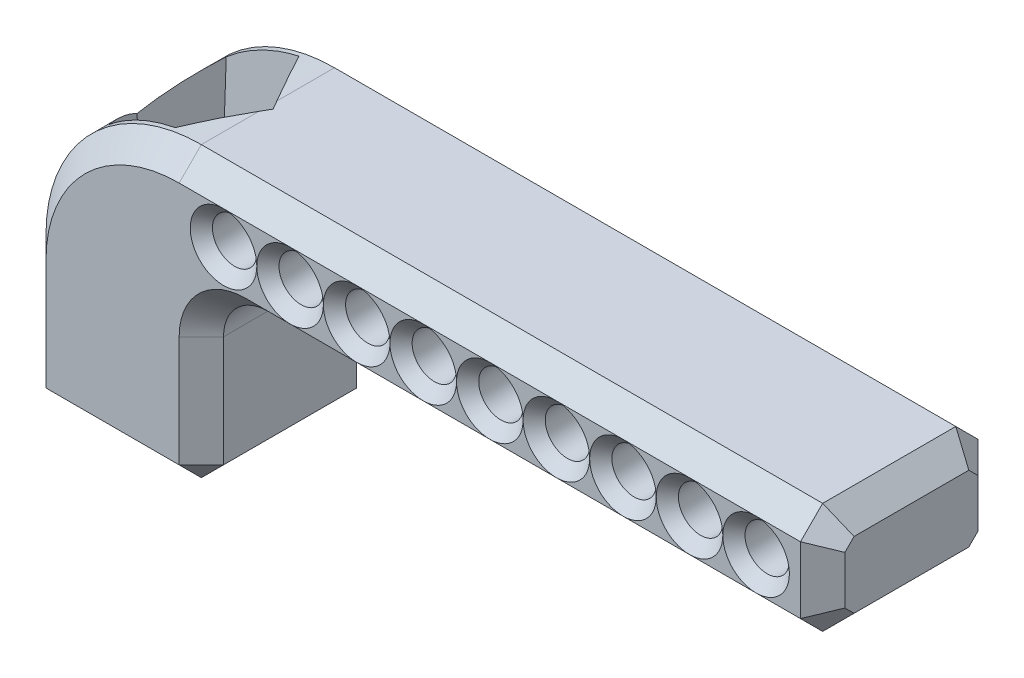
ISO-10303-21;
HEADER;
FILE_DESCRIPTION(('STEP AP214'),'2;1');
FILE_NAME('part.step','',(''),(''),'','','');
FILE_SCHEMA(('AUTOMOTIVE_DESIGN { 1 0 10303 214 1 1 1 1 }'));
ENDSEC;
DATA;
#1=APPLICATION_CONTEXT('core data for automotive mechanical design processes');
#2=APPLICATION_PROTOCOL_DEFINITION('international standard','automotive_design',2000,#1);
#3=PRODUCT_CONTEXT('',#1,'mechanical');
#4=PRODUCT('Part','Part','',(#3));
#5=PRODUCT_RELATED_PRODUCT_CATEGORY('part','',(#4));
#6=PRODUCT_DEFINITION_FORMATION('','',#4);
#7=PRODUCT_DEFINITION_CONTEXT('part definition',#1,'design');
#8=PRODUCT_DEFINITION('design','',#6,#7);
#9=PRODUCT_DEFINITION_SHAPE('','',#8);
#10=(LENGTH_UNIT() NAMED_UNIT(*) SI_UNIT(.MILLI.,.METRE.));
#11=(NAMED_UNIT(*) PLANE_ANGLE_UNIT() SI_UNIT($,.RADIAN.));
#12=(NAMED_UNIT(*) SI_UNIT($,.STERADIAN.) SOLID_ANGLE_UNIT());
#13=UNCERTAINTY_MEASURE_WITH_UNIT(LENGTH_MEASURE(1.E-05),#10,'distance_accuracy_value','');
#14=(GEOMETRIC_REPRESENTATION_CONTEXT(3) GLOBAL_UNCERTAINTY_ASSIGNED_CONTEXT((#13)) GLOBAL_UNIT_ASSIGNED_CONTEXT((#10,
#11,#12)) REPRESENTATION_CONTEXT('',''));
#15=CARTESIAN_POINT('',(0.,0.,0.));
#16=DIRECTION('',(0.,0.,1.));
#17=DIRECTION('',(1.,0.,0.));
#18=AXIS2_PLACEMENT_3D('',#15,#16,#17);
#19=CARTESIAN_POINT('',(0.,0.,12.7));
#20=DIRECTION('',(0.,0.,1.));
#21=DIRECTION('',(1.,0.,0.));
#22=AXIS2_PLACEMENT_3D('',#19,#20,#21);
#23=PLANE('',#22);
#24=DIRECTION('',(-1.,0.,0.));
#25=VECTOR('',#24,1.);
#26=CARTESIAN_POINT('',(0.,12.7,12.7));
#27=LINE('',#26,#25);
#28=CARTESIAN_POINT('',(38.1,12.7,12.7));
#29=VERTEX_POINT('',#28);
#30=CARTESIAN_POINT('',(28.575,12.7,12.7));
#31=VERTEX_POINT('',#30);
#32=EDGE_CURVE('E937',#29,#31,#27,.T.);
#33=ORIENTED_EDGE('',*,*,#32,.T.);
#34=CARTESIAN_POINT('',(28.575,7.93750000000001,12.7));
#35=DIRECTION('',(0.,0.,1.));
#36=DIRECTION('',(1.,0.,0.));
#37=AXIS2_PLACEMENT_3D('',#34,#35,#36);
#38=CIRCLE('',#37,4.76250000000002);
#39=CARTESIAN_POINT('',(33.3375,7.93750000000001,12.7));
#40=VERTEX_POINT('',#39);
#41=EDGE_CURVE('E820',#31,#40,#38,.F.);
#42=ORIENTED_EDGE('',*,*,#41,.T.);
#43=CARTESIAN_POINT('',(38.1,7.93750000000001,12.7));
#44=DIRECTION('',(0.,0.,1.));
#45=DIRECTION('',(1.,0.,0.));
#46=AXIS2_PLACEMENT_3D('',#43,#44,#45);
#47=CIRCLE('',#46,4.76250000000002);
#48=EDGE_CURVE('E811',#40,#29,#47,.F.);
#49=ORIENTED_EDGE('',*,*,#48,.T.);
#50=EDGE_LOOP('',(#33,#42,#49));
#51=FACE_BOUND('',#50,.T.);
#52=ADVANCED_FACE('F35',(#51),#23,.T.);
#53=CARTESIAN_POINT('',(47.625,12.7,12.7));
#54=VERTEX_POINT('',#53);
#55=EDGE_CURVE('E926',#54,#29,#27,.T.);
#56=ORIENTED_EDGE('',*,*,#55,.T.);
#57=CARTESIAN_POINT('',(38.1,7.93750000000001,12.7));
#58=DIRECTION('',(0.,0.,1.));
#59=DIRECTION('',(1.,0.,0.));
#60=AXIS2_PLACEMENT_3D('',#57,#58,#59);
#61=CIRCLE('',#60,4.76250000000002);
#62=CARTESIAN_POINT('',(42.8625,7.93750000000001,12.7));
#63=VERTEX_POINT('',#62);
#64=EDGE_CURVE('E817',#29,#63,#61,.F.);
#65=ORIENTED_EDGE('',*,*,#64,.T.);
#66=CARTESIAN_POINT('',(47.625,7.93750000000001,12.7));
#67=DIRECTION('',(0.,0.,1.));
#68=DIRECTION('',(1.,0.,0.));
#69=AXIS2_PLACEMENT_3D('',#66,#67,#68);
#70=CIRCLE('',#69,4.76250000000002);
#71=EDGE_CURVE('E801',#63,#54,#70,.F.);
#72=ORIENTED_EDGE('',*,*,#71,.T.);
#73=EDGE_LOOP('',(#56,#65,#72));
#74=FACE_BOUND('',#73,.T.);
#75=ADVANCED_FACE('F925',(#74),#23,.T.);
#76=CARTESIAN_POINT('',(47.625,7.93750000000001,12.7));
#77=DIRECTION('',(0.,0.,1.));
#78=DIRECTION('',(1.,0.,0.));
#79=AXIS2_PLACEMENT_3D('',#76,#77,#78);
#80=CIRCLE('',#79,4.76250000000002);
#81=CARTESIAN_POINT('',(47.625,3.17500000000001,12.7));
#82=VERTEX_POINT('',#81);
#83=EDGE_CURVE('E803',#82,#63,#80,.F.);
#84=ORIENTED_EDGE('',*,*,#83,.T.);
#85=CARTESIAN_POINT('',(38.1,7.93750000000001,12.7));
#86=DIRECTION('',(0.,0.,1.));
#87=DIRECTION('',(1.,0.,0.));
#88=AXIS2_PLACEMENT_3D('',#85,#86,#87);
#89=CIRCLE('',#88,4.76250000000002);
#90=CARTESIAN_POINT('',(38.1,3.17500000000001,12.7));
#91=VERTEX_POINT('',#90);
#92=EDGE_CURVE('E57',#63,#91,#89,.F.);
#93=ORIENTED_EDGE('',*,*,#92,.T.);
#94=DIRECTION('',(1.,0.,0.));
#95=VECTOR('',#94,1.);
#96=CARTESIAN_POINT('',(114.3,3.17500000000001,12.7));
#97=LINE('',#96,#95);
#98=EDGE_CURVE('E465',#91,#82,#97,.T.);
#99=ORIENTED_EDGE('',*,*,#98,.T.);
#100=EDGE_LOOP('',(#84,#93,#99));
#101=FACE_BOUND('',#100,.T.);
#102=ADVANCED_FACE('F916',(#101),#23,.T.);
#103=CARTESIAN_POINT('',(57.15,12.7,12.7));
#104=VERTEX_POINT('',#103);
#105=EDGE_CURVE('E933',#104,#54,#27,.T.);
#106=ORIENTED_EDGE('',*,*,#105,.T.);
#107=CARTESIAN_POINT('',(47.625,7.93750000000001,12.7));
#108=DIRECTION('',(0.,0.,1.));
#109=DIRECTION('',(1.,0.,0.));
#110=AXIS2_PLACEMENT_3D('',#107,#108,#109);
#111=CIRCLE('',#110,4.76250000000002);
#112=CARTESIAN_POINT('',(52.3875,7.93750000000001,12.7));
#113=VERTEX_POINT('',#112);
#114=EDGE_CURVE('E808',#54,#113,#111,.F.);
#115=ORIENTED_EDGE('',*,*,#114,.T.);
#116=CARTESIAN_POINT('',(57.15,7.93750000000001,12.7));
#117=DIRECTION('',(0.,0.,1.));
#118=DIRECTION('',(1.,0.,0.));
#119=AXIS2_PLACEMENT_3D('',#116,#117,#118);
#120=CIRCLE('',#119,4.76250000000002);
#121=EDGE_CURVE('E791',#113,#104,#120,.F.);
#122=ORIENTED_EDGE('',*,*,#121,.T.);
#123=EDGE_LOOP('',(#106,#115,#122));
#124=FACE_BOUND('',#123,.T.);
#125=ADVANCED_FACE('F939',(#124),#23,.T.);
#126=CARTESIAN_POINT('',(57.15,7.93750000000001,12.7));
#127=DIRECTION('',(0.,0.,1.));
#128=DIRECTION('',(1.,0.,0.));
#129=AXIS2_PLACEMENT_3D('',#126,#127,#128);
#130=CIRCLE('',#129,4.76250000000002);
#131=CARTESIAN_POINT('',(57.15,3.17500000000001,12.7));
#132=VERTEX_POINT('',#131);
#133=EDGE_CURVE('E793',#132,#113,#130,.F.);
#134=ORIENTED_EDGE('',*,*,#133,.T.);
#135=CARTESIAN_POINT('',(47.625,7.93750000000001,12.7));
#136=DIRECTION('',(0.,0.,1.));
#137=DIRECTION('',(1.,0.,0.));
#138=AXIS2_PLACEMENT_3D('',#135,#136,#137);
#139=CIRCLE('',#138,4.76250000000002);
#140=EDGE_CURVE('E806',#113,#82,#139,.F.);
#141=ORIENTED_EDGE('',*,*,#140,.T.);
#142=EDGE_CURVE('E904',#82,#132,#97,.T.);
#143=ORIENTED_EDGE('',*,*,#142,.T.);
#144=EDGE_LOOP('',(#134,#141,#143));
#145=FACE_BOUND('',#144,.T.);
#146=ADVANCED_FACE('F1078',(#145),#23,.T.);
#147=CARTESIAN_POINT('',(66.675,12.7,12.7));
#148=VERTEX_POINT('',#147);
#149=EDGE_CURVE('E941',#148,#104,#27,.T.);
#150=ORIENTED_EDGE('',*,*,#149,.T.);
#151=CARTESIAN_POINT('',(57.15,7.93750000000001,12.7));
#152=DIRECTION('',(0.,0.,1.));
#153=DIRECTION('',(1.,0.,0.));
#154=AXIS2_PLACEMENT_3D('',#151,#152,#153);
#155=CIRCLE('',#154,4.76250000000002);
#156=CARTESIAN_POINT('',(61.9125,7.93750000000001,12.7));
#157=VERTEX_POINT('',#156);
#158=EDGE_CURVE('E798',#104,#157,#155,.F.);
#159=ORIENTED_EDGE('',*,*,#158,.T.);
#160=CARTESIAN_POINT('',(66.675,7.93750000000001,12.7));
#161=DIRECTION('',(0.,0.,1.));
#162=DIRECTION('',(1.,0.,0.));
#163=AXIS2_PLACEMENT_3D('',#160,#161,#162);
#164=CIRCLE('',#163,4.76250000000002);
#165=EDGE_CURVE('E781',#157,#148,#164,.F.);
#166=ORIENTED_EDGE('',*,*,#165,.T.);
#167=EDGE_LOOP('',(#150,#159,#166));
#168=FACE_BOUND('',#167,.T.);
#169=ADVANCED_FACE('F1069',(#168),#23,.T.);
#170=CARTESIAN_POINT('',(66.675,7.93750000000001,12.7));
#171=DIRECTION('',(0.,0.,1.));
#172=DIRECTION('',(1.,0.,0.));
#173=AXIS2_PLACEMENT_3D('',#170,#171,#172);
#174=CIRCLE('',#173,4.76250000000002);
#175=CARTESIAN_POINT('',(66.675,3.17500000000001,12.7));
#176=VERTEX_POINT('',#175);
#177=EDGE_CURVE('E783',#176,#157,#174,.F.);
#178=ORIENTED_EDGE('',*,*,#177,.T.);
#179=CARTESIAN_POINT('',(57.15,7.93750000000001,12.7));
#180=DIRECTION('',(0.,0.,1.));
#181=DIRECTION('',(1.,0.,0.));
#182=AXIS2_PLACEMENT_3D('',#179,#180,#181);
#183=CIRCLE('',#182,4.76250000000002);
#184=EDGE_CURVE('E796',#157,#132,#183,.F.);
#185=ORIENTED_EDGE('',*,*,#184,.T.);
#186=EDGE_CURVE('E899',#132,#176,#97,.T.);
#187=ORIENTED_EDGE('',*,*,#186,.T.);
#188=EDGE_LOOP('',(#178,#185,#187));
#189=FACE_BOUND('',#188,.T.);
#190=ADVANCED_FACE('F1060',(#189),#23,.T.);
#191=CARTESIAN_POINT('',(76.2,12.7,12.7));
#192=VERTEX_POINT('',#191);
#193=EDGE_CURVE('E942',#192,#148,#27,.T.);
#194=ORIENTED_EDGE('',*,*,#193,.T.);
#195=CARTESIAN_POINT('',(66.675,7.93750000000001,12.7));
#196=DIRECTION('',(0.,0.,1.));
#197=DIRECTION('',(1.,0.,0.));
#198=AXIS2_PLACEMENT_3D('',#195,#196,#197);
#199=CIRCLE('',#198,4.76250000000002);
#200=CARTESIAN_POINT('',(71.4375,7.93750000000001,12.7));
#201=VERTEX_POINT('',#200);
#202=EDGE_CURVE('E788',#148,#201,#199,.F.);
#203=ORIENTED_EDGE('',*,*,#202,.T.);
#204=CARTESIAN_POINT('',(76.2,7.93750000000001,12.7));
#205=DIRECTION('',(0.,0.,1.));
#206=DIRECTION('',(1.,0.,0.));
#207=AXIS2_PLACEMENT_3D('',#204,#205,#206);
#208=CIRCLE('',#207,4.76250000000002);
#209=EDGE_CURVE('E771',#201,#192,#208,.F.);
#210=ORIENTED_EDGE('',*,*,#209,.T.);
#211=EDGE_LOOP('',(#194,#203,#210));
#212=FACE_BOUND('',#211,.T.);
#213=ADVANCED_FACE('F1051',(#212),#23,.T.);
#214=CARTESIAN_POINT('',(76.2,7.93750000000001,12.7));
#215=DIRECTION('',(0.,0.,1.));
#216=DIRECTION('',(1.,0.,0.));
#217=AXIS2_PLACEMENT_3D('',#214,#215,#216);
#218=CIRCLE('',#217,4.76250000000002);
#219=CARTESIAN_POINT('',(76.2,3.17500000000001,12.7));
#220=VERTEX_POINT('',#219);
#221=EDGE_CURVE('E773',#220,#201,#218,.F.);
#222=ORIENTED_EDGE('',*,*,#221,.T.);
#223=CARTESIAN_POINT('',(66.675,7.93750000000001,12.7));
#224=DIRECTION('',(0.,0.,1.));
#225=DIRECTION('',(1.,0.,0.));
#226=AXIS2_PLACEMENT_3D('',#223,#224,#225);
#227=CIRCLE('',#226,4.76250000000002);
#228=EDGE_CURVE('E786',#201,#176,#227,.F.);
#229=ORIENTED_EDGE('',*,*,#228,.T.);
#230=EDGE_CURVE('E894',#176,#220,#97,.T.);
#231=ORIENTED_EDGE('',*,*,#230,.T.);
#232=EDGE_LOOP('',(#222,#229,#231));
#233=FACE_BOUND('',#232,.T.);
#234=ADVANCED_FACE('F1042',(#233),#23,.T.);
#235=CARTESIAN_POINT('',(85.725,12.7,12.7));
#236=VERTEX_POINT('',#235);
#237=EDGE_CURVE('E946',#236,#192,#27,.T.);
#238=ORIENTED_EDGE('',*,*,#237,.T.);
#239=CARTESIAN_POINT('',(76.2,7.93750000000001,12.7));
#240=DIRECTION('',(0.,0.,1.));
#241=DIRECTION('',(1.,0.,0.));
#242=AXIS2_PLACEMENT_3D('',#239,#240,#241);
#243=CIRCLE('',#242,4.76250000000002);
#244=CARTESIAN_POINT('',(80.9625,7.93750000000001,12.7));
#245=VERTEX_POINT('',#244);
#246=EDGE_CURVE('E778',#192,#245,#243,.F.);
#247=ORIENTED_EDGE('',*,*,#246,.T.);
#248=CARTESIAN_POINT('',(85.725,7.93750000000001,12.7));
#249=DIRECTION('',(0.,0.,1.));
#250=DIRECTION('',(1.,0.,0.));
#251=AXIS2_PLACEMENT_3D('',#248,#249,#250);
#252=CIRCLE('',#251,4.76250000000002);
#253=EDGE_CURVE('E761',#245,#236,#252,.F.);
#254=ORIENTED_EDGE('',*,*,#253,.T.);
#255=EDGE_LOOP('',(#238,#247,#254));
#256=FACE_BOUND('',#255,.T.);
#257=ADVANCED_FACE('F979',(#256),#23,.T.);
#258=CARTESIAN_POINT('',(85.725,7.93750000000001,12.7));
#259=DIRECTION('',(0.,0.,1.));
#260=DIRECTION('',(1.,0.,0.));
#261=AXIS2_PLACEMENT_3D('',#258,#259,#260);
#262=CIRCLE('',#261,4.76250000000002);
#263=CARTESIAN_POINT('',(85.725,3.17500000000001,12.7));
#264=VERTEX_POINT('',#263);
#265=EDGE_CURVE('E763',#264,#245,#262,.F.);
#266=ORIENTED_EDGE('',*,*,#265,.T.);
#267=CARTESIAN_POINT('',(76.2,7.93750000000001,12.7));
#268=DIRECTION('',(0.,0.,1.));
#269=DIRECTION('',(1.,0.,0.));
#270=AXIS2_PLACEMENT_3D('',#267,#268,#269);
#271=CIRCLE('',#270,4.76250000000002);
#272=EDGE_CURVE('E776',#245,#220,#271,.F.);
#273=ORIENTED_EDGE('',*,*,#272,.T.);
#274=EDGE_CURVE('E890',#220,#264,#97,.T.);
#275=ORIENTED_EDGE('',*,*,#274,.T.);
#276=EDGE_LOOP('',(#266,#273,#275));
#277=FACE_BOUND('',#276,.T.);
#278=ADVANCED_FACE('F973',(#277),#23,.T.);
#279=CARTESIAN_POINT('',(95.25,12.7,12.7));
#280=VERTEX_POINT('',#279);
#281=EDGE_CURVE('E951',#280,#236,#27,.T.);
#282=ORIENTED_EDGE('',*,*,#281,.T.);
#283=CARTESIAN_POINT('',(85.725,7.93750000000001,12.7));
#284=DIRECTION('',(0.,0.,1.));
#285=DIRECTION('',(1.,0.,0.));
#286=AXIS2_PLACEMENT_3D('',#283,#284,#285);
#287=CIRCLE('',#286,4.76250000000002);
#288=CARTESIAN_POINT('',(90.4875,7.93750000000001,12.7));
#289=VERTEX_POINT('',#288);
#290=EDGE_CURVE('E768',#236,#289,#287,.F.);
#291=ORIENTED_EDGE('',*,*,#290,.T.);
#292=CARTESIAN_POINT('',(95.25,7.93750000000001,12.7));
#293=DIRECTION('',(0.,0.,1.));
#294=DIRECTION('',(1.,0.,0.));
#295=AXIS2_PLACEMENT_3D('',#292,#293,#294);
#296=CIRCLE('',#295,4.76250000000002);
#297=EDGE_CURVE('E751',#289,#280,#296,.F.);
#298=ORIENTED_EDGE('',*,*,#297,.T.);
#299=EDGE_LOOP('',(#282,#291,#298));
#300=FACE_BOUND('',#299,.T.);
#301=ADVANCED_FACE('F971',(#300),#23,.T.);
#302=CARTESIAN_POINT('',(95.25,7.93750000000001,12.7));
#303=DIRECTION('',(0.,0.,1.));
#304=DIRECTION('',(1.,0.,0.));
#305=AXIS2_PLACEMENT_3D('',#302,#303,#304);
#306=CIRCLE('',#305,4.76250000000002);
#307=CARTESIAN_POINT('',(95.25,3.17500000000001,12.7));
#308=VERTEX_POINT('',#307);
#309=EDGE_CURVE('E753',#308,#289,#306,.F.);
#310=ORIENTED_EDGE('',*,*,#309,.T.);
#311=CARTESIAN_POINT('',(85.725,7.93750000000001,12.7));
#312=DIRECTION('',(0.,0.,1.));
#313=DIRECTION('',(1.,0.,0.));
#314=AXIS2_PLACEMENT_3D('',#311,#312,#313);
#315=CIRCLE('',#314,4.76250000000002);
#316=EDGE_CURVE('E766',#289,#264,#315,.F.);
#317=ORIENTED_EDGE('',*,*,#316,.T.);
#318=EDGE_CURVE('E889',#264,#308,#97,.T.);
#319=ORIENTED_EDGE('',*,*,#318,.T.);
#320=EDGE_LOOP('',(#310,#317,#319));
#321=FACE_BOUND('',#320,.T.);
#322=ADVANCED_FACE('F967',(#321),#23,.T.);
#323=CARTESIAN_POINT('',(104.775,12.7,12.7));
#324=VERTEX_POINT('',#323);
#325=EDGE_CURVE('E480',#324,#280,#27,.T.);
#326=ORIENTED_EDGE('',*,*,#325,.T.);
#327=CARTESIAN_POINT('',(95.25,7.93750000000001,12.7));
#328=DIRECTION('',(0.,0.,1.));
#329=DIRECTION('',(1.,0.,0.));
#330=AXIS2_PLACEMENT_3D('',#327,#328,#329);
#331=CIRCLE('',#330,4.76250000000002);
#332=CARTESIAN_POINT('',(100.0125,7.93750000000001,12.7));
#333=VERTEX_POINT('',#332);
#334=EDGE_CURVE('E758',#280,#333,#331,.F.);
#335=ORIENTED_EDGE('',*,*,#334,.T.);
#336=CARTESIAN_POINT('',(104.775,7.93750000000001,12.7));
#337=DIRECTION('',(0.,0.,1.));
#338=DIRECTION('',(1.,0.,0.));
#339=AXIS2_PLACEMENT_3D('',#336,#337,#338);
#340=CIRCLE('',#339,4.76250000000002);
#341=EDGE_CURVE('E743',#333,#324,#340,.F.);
#342=ORIENTED_EDGE('',*,*,#341,.T.);
#343=EDGE_LOOP('',(#326,#335,#342));
#344=FACE_BOUND('',#343,.T.);
#345=ADVANCED_FACE('F963',(#344),#23,.T.);
#346=CARTESIAN_POINT('',(104.775,7.93750000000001,12.7));
#347=DIRECTION('',(0.,0.,1.));
#348=DIRECTION('',(1.,0.,0.));
#349=AXIS2_PLACEMENT_3D('',#346,#347,#348);
#350=CIRCLE('',#349,4.76250000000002);
#351=CARTESIAN_POINT('',(104.775,3.17500000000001,12.7));
#352=VERTEX_POINT('',#351);
#353=EDGE_CURVE('E745',#352,#333,#350,.F.);
#354=ORIENTED_EDGE('',*,*,#353,.T.);
#355=CARTESIAN_POINT('',(95.25,7.93750000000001,12.7));
#356=DIRECTION('',(0.,0.,1.));
#357=DIRECTION('',(1.,0.,0.));
#358=AXIS2_PLACEMENT_3D('',#355,#356,#357);
#359=CIRCLE('',#358,4.76250000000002);
#360=EDGE_CURVE('E756',#333,#308,#359,.F.);
#361=ORIENTED_EDGE('',*,*,#360,.T.);
#362=EDGE_CURVE('E884',#308,#352,#97,.T.);
#363=ORIENTED_EDGE('',*,*,#362,.T.);
#364=EDGE_LOOP('',(#354,#361,#363));
#365=FACE_BOUND('',#364,.T.);
#366=ADVANCED_FACE('F888',(#365),#23,.T.);
#367=CARTESIAN_POINT('',(111.125,12.7,12.7));
#368=VERTEX_POINT('',#367);
#369=EDGE_CURVE('E476',#368,#324,#27,.T.);
#370=ORIENTED_EDGE('',*,*,#369,.T.);
#371=CARTESIAN_POINT('',(104.775,7.93750000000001,12.7));
#372=DIRECTION('',(0.,0.,1.));
#373=DIRECTION('',(1.,0.,0.));
#374=AXIS2_PLACEMENT_3D('',#371,#372,#373);
#375=CIRCLE('',#374,4.76250000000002);
#376=EDGE_CURVE('E748',#324,#352,#375,.F.);
#377=ORIENTED_EDGE('',*,*,#376,.T.);
#378=CARTESIAN_POINT('',(111.125,3.17500000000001,12.7));
#379=VERTEX_POINT('',#378);
#380=EDGE_CURVE('E460',#352,#379,#97,.T.);
#381=ORIENTED_EDGE('',*,*,#380,.T.);
#382=DIRECTION('',(0.,1.,0.));
#383=VECTOR('',#382,1.);
#384=CARTESIAN_POINT('',(111.125,12.7,12.7));
#385=LINE('',#384,#383);
#386=EDGE_CURVE('E608',#379,#368,#385,.T.);
#387=ORIENTED_EDGE('',*,*,#386,.T.);
#388=EDGE_LOOP('',(#370,#377,#381,#387));
#389=FACE_BOUND('',#388,.T.);
#390=ADVANCED_FACE('F877',(#389),#23,.T.);
#391=CARTESIAN_POINT('',(0.,0.,-12.7));
#392=DIRECTION('',(0.,0.,1.));
#393=DIRECTION('',(1.,0.,0.));
#394=AXIS2_PLACEMENT_3D('',#391,#392,#393);
#395=PLANE('',#394);
#396=DIRECTION('',(1.,0.,0.));
#397=VECTOR('',#396,1.);
#398=CARTESIAN_POINT('',(114.3,12.7,-12.7));
#399=LINE('',#398,#397);
#400=CARTESIAN_POINT('',(22.225,12.7,-12.7));
#401=VERTEX_POINT('',#400);
#402=CARTESIAN_POINT('',(28.575,12.7,-12.7));
#403=VERTEX_POINT('',#402);
#404=EDGE_CURVE('E502',#401,#403,#399,.T.);
#405=ORIENTED_EDGE('',*,*,#404,.T.);
#406=CARTESIAN_POINT('',(28.575,7.93750000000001,-12.7));
#407=DIRECTION('',(0.,0.,1.));
#408=DIRECTION('',(1.,0.,0.));
#409=AXIS2_PLACEMENT_3D('',#406,#407,#408);
#410=CIRCLE('',#409,4.76250000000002);
#411=CARTESIAN_POINT('',(33.3375,7.93750000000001,-12.7));
#412=VERTEX_POINT('',#411);
#413=EDGE_CURVE('E740',#403,#412,#410,.T.);
#414=ORIENTED_EDGE('',*,*,#413,.T.);
#415=CARTESIAN_POINT('',(38.1,7.93750000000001,-12.7));
#416=DIRECTION('',(0.,0.,1.));
#417=DIRECTION('',(1.,0.,0.));
#418=AXIS2_PLACEMENT_3D('',#415,#416,#417);
#419=CIRCLE('',#418,4.76250000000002);
#420=CARTESIAN_POINT('',(38.1,3.17500000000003,-12.7));
#421=VERTEX_POINT('',#420);
#422=EDGE_CURVE('E728',#412,#421,#419,.T.);
#423=ORIENTED_EDGE('',*,*,#422,.T.);
#424=DIRECTION('',(-1.,0.,0.));
#425=VECTOR('',#424,1.);
#426=CARTESIAN_POINT('',(0.,3.17500000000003,-12.7));
#427=LINE('',#426,#425);
#428=CARTESIAN_POINT('',(31.75,3.17500000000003,-12.7));
#429=VERTEX_POINT('',#428);
#430=EDGE_CURVE('E486',#421,#429,#427,.T.);
#431=ORIENTED_EDGE('',*,*,#430,.T.);
#432=CARTESIAN_POINT('',(31.75,-6.35,-12.7));
#433=DIRECTION('',(0.,0.,1.));
#434=DIRECTION('',(1.,0.,0.));
#435=AXIS2_PLACEMENT_3D('',#432,#433,#434);
#436=CIRCLE('',#435,9.52500000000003);
#437=CARTESIAN_POINT('',(22.225,-6.35,-12.7));
#438=VERTEX_POINT('',#437);
#439=EDGE_CURVE('E490',#429,#438,#436,.T.);
#440=ORIENTED_EDGE('',*,*,#439,.T.);
#441=DIRECTION('',(0.,-1.,0.));
#442=VECTOR('',#441,1.);
#443=CARTESIAN_POINT('',(22.225,-25.4,-12.7));
#444=LINE('',#443,#442);
#445=CARTESIAN_POINT('',(22.225,-22.225,-12.7));
#446=VERTEX_POINT('',#445);
#447=EDGE_CURVE('E493',#438,#446,#444,.T.);
#448=ORIENTED_EDGE('',*,*,#447,.T.);
#449=DIRECTION('',(-1.,0.,0.));
#450=VECTOR('',#449,1.);
#451=CARTESIAN_POINT('',(0.,-22.225,-12.7));
#452=LINE('',#451,#450);
#453=CARTESIAN_POINT('',(3.17500000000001,-22.225,-12.7));
#454=VERTEX_POINT('',#453);
#455=EDGE_CURVE('E495',#446,#454,#452,.T.);
#456=ORIENTED_EDGE('',*,*,#455,.T.);
#457=DIRECTION('',(0.,1.,0.));
#458=VECTOR('',#457,1.);
#459=CARTESIAN_POINT('',(3.17500000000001,-6.35,-12.7));
#460=LINE('',#459,#458);
#461=CARTESIAN_POINT('',(3.17500000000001,-6.35,-12.7));
#462=VERTEX_POINT('',#461);
#463=EDGE_CURVE('E497',#454,#462,#460,.T.);
#464=ORIENTED_EDGE('',*,*,#463,.T.);
#465=CARTESIAN_POINT('',(22.225,-6.35,-12.7));
#466=DIRECTION('',(0.,0.,1.));
#467=DIRECTION('',(1.,0.,0.));
#468=AXIS2_PLACEMENT_3D('',#465,#466,#467);
#469=CIRCLE('',#468,19.05);
#470=EDGE_CURVE('E499',#462,#401,#469,.F.);
#471=ORIENTED_EDGE('',*,*,#470,.T.);
#472=EDGE_LOOP('',(#405,#414,#423,#431,#440,#448,#456,#464,#471));
#473=FACE_BOUND('',#472,.T.);
#474=ADVANCED_FACE('F998',(#473),#395,.F.);
#475=CARTESIAN_POINT('',(47.625,3.17500000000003,-12.7));
#476=VERTEX_POINT('',#475);
#477=EDGE_CURVE('E2006',#476,#421,#427,.T.);
#478=ORIENTED_EDGE('',*,*,#477,.T.);
#479=CARTESIAN_POINT('',(38.1,7.93750000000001,-12.7));
#480=DIRECTION('',(0.,0.,1.));
#481=DIRECTION('',(1.,0.,0.));
#482=AXIS2_PLACEMENT_3D('',#479,#480,#481);
#483=CIRCLE('',#482,4.76250000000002);
#484=CARTESIAN_POINT('',(42.8625,7.93750000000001,-12.7));
#485=VERTEX_POINT('',#484);
#486=EDGE_CURVE('E735',#421,#485,#483,.T.);
#487=ORIENTED_EDGE('',*,*,#486,.T.);
#488=CARTESIAN_POINT('',(47.625,7.93750000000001,-12.7));
#489=DIRECTION('',(0.,0.,1.));
#490=DIRECTION('',(1.,0.,0.));
#491=AXIS2_PLACEMENT_3D('',#488,#489,#490);
#492=CIRCLE('',#491,4.76250000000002);
#493=EDGE_CURVE('E718',#485,#476,#492,.T.);
#494=ORIENTED_EDGE('',*,*,#493,.T.);
#495=EDGE_LOOP('',(#478,#487,#494));
#496=FACE_BOUND('',#495,.T.);
#497=ADVANCED_FACE('F1008',(#496),#395,.F.);
#498=CARTESIAN_POINT('',(47.625,7.93750000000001,-12.7));
#499=DIRECTION('',(0.,0.,1.));
#500=DIRECTION('',(1.,0.,0.));
#501=AXIS2_PLACEMENT_3D('',#498,#499,#500);
#502=CIRCLE('',#501,4.76250000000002);
#503=CARTESIAN_POINT('',(47.625,12.7,-12.7));
#504=VERTEX_POINT('',#503);
#505=EDGE_CURVE('E720',#504,#485,#502,.T.);
#506=ORIENTED_EDGE('',*,*,#505,.T.);
#507=CARTESIAN_POINT('',(38.1,7.93750000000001,-12.7));
#508=DIRECTION('',(0.,0.,1.));
#509=DIRECTION('',(1.,0.,0.));
#510=AXIS2_PLACEMENT_3D('',#507,#508,#509);
#511=CIRCLE('',#510,4.76250000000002);
#512=CARTESIAN_POINT('',(38.1,12.7,-12.7));
#513=VERTEX_POINT('',#512);
#514=EDGE_CURVE('E733',#485,#513,#511,.T.);
#515=ORIENTED_EDGE('',*,*,#514,.T.);
#516=EDGE_CURVE('E2018',#513,#504,#399,.T.);
#517=ORIENTED_EDGE('',*,*,#516,.T.);
#518=EDGE_LOOP('',(#506,#515,#517));
#519=FACE_BOUND('',#518,.T.);
#520=ADVANCED_FACE('F1950',(#519),#395,.F.);
#521=CARTESIAN_POINT('',(57.15,3.17500000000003,-12.7));
#522=VERTEX_POINT('',#521);
#523=EDGE_CURVE('E2012',#522,#476,#427,.T.);
#524=ORIENTED_EDGE('',*,*,#523,.T.);
#525=CARTESIAN_POINT('',(47.625,7.93750000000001,-12.7));
#526=DIRECTION('',(0.,0.,1.));
#527=DIRECTION('',(1.,0.,0.));
#528=AXIS2_PLACEMENT_3D('',#525,#526,#527);
#529=CIRCLE('',#528,4.76250000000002);
#530=CARTESIAN_POINT('',(52.3875,7.93750000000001,-12.7));
#531=VERTEX_POINT('',#530);
#532=EDGE_CURVE('E725',#476,#531,#529,.T.);
#533=ORIENTED_EDGE('',*,*,#532,.T.);
#534=CARTESIAN_POINT('',(57.15,7.93750000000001,-12.7));
#535=DIRECTION('',(0.,0.,1.));
#536=DIRECTION('',(1.,0.,0.));
#537=AXIS2_PLACEMENT_3D('',#534,#535,#536);
#538=CIRCLE('',#537,4.76250000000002);
#539=EDGE_CURVE('E708',#531,#522,#538,.T.);
#540=ORIENTED_EDGE('',*,*,#539,.T.);
#541=EDGE_LOOP('',(#524,#533,#540));
#542=FACE_BOUND('',#541,.T.);
#543=ADVANCED_FACE('F1940',(#542),#395,.F.);
#544=CARTESIAN_POINT('',(57.15,7.93750000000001,-12.7));
#545=DIRECTION('',(0.,0.,1.));
#546=DIRECTION('',(1.,0.,0.));
#547=AXIS2_PLACEMENT_3D('',#544,#545,#546);
#548=CIRCLE('',#547,4.76250000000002);
#549=CARTESIAN_POINT('',(57.15,12.7,-12.7));
#550=VERTEX_POINT('',#549);
#551=EDGE_CURVE('E710',#550,#531,#548,.T.);
#552=ORIENTED_EDGE('',*,*,#551,.T.);
#553=CARTESIAN_POINT('',(47.625,7.93750000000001,-12.7));
#554=DIRECTION('',(0.,0.,1.));
#555=DIRECTION('',(1.,0.,0.));
#556=AXIS2_PLACEMENT_3D('',#553,#554,#555);
#557=CIRCLE('',#556,4.76250000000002);
#558=EDGE_CURVE('E723',#531,#504,#557,.T.);
#559=ORIENTED_EDGE('',*,*,#558,.T.);
#560=EDGE_CURVE('E2027',#504,#550,#399,.T.);
#561=ORIENTED_EDGE('',*,*,#560,.T.);
#562=EDGE_LOOP('',(#552,#559,#561));
#563=FACE_BOUND('',#562,.T.);
#564=ADVANCED_FACE('F1930',(#563),#395,.F.);
#565=CARTESIAN_POINT('',(66.675,3.17500000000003,-12.7));
#566=VERTEX_POINT('',#565);
#567=EDGE_CURVE('E2104',#566,#522,#427,.T.);
#568=ORIENTED_EDGE('',*,*,#567,.T.);
#569=CARTESIAN_POINT('',(57.15,7.93750000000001,-12.7));
#570=DIRECTION('',(0.,0.,1.));
#571=DIRECTION('',(1.,0.,0.));
#572=AXIS2_PLACEMENT_3D('',#569,#570,#571);
#573=CIRCLE('',#572,4.76250000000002);
#574=CARTESIAN_POINT('',(61.9125,7.93750000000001,-12.7));
#575=VERTEX_POINT('',#574);
#576=EDGE_CURVE('E715',#522,#575,#573,.T.);
#577=ORIENTED_EDGE('',*,*,#576,.T.);
#578=CARTESIAN_POINT('',(66.675,7.93750000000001,-12.7));
#579=DIRECTION('',(0.,0.,1.));
#580=DIRECTION('',(1.,0.,0.));
#581=AXIS2_PLACEMENT_3D('',#578,#579,#580);
#582=CIRCLE('',#581,4.76250000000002);
#583=EDGE_CURVE('E698',#575,#566,#582,.T.);
#584=ORIENTED_EDGE('',*,*,#583,.T.);
#585=EDGE_LOOP('',(#568,#577,#584));
#586=FACE_BOUND('',#585,.T.);
#587=ADVANCED_FACE('F1920',(#586),#395,.F.);
#588=CARTESIAN_POINT('',(66.675,7.93750000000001,-12.7));
#589=DIRECTION('',(0.,0.,1.));
#590=DIRECTION('',(1.,0.,0.));
#591=AXIS2_PLACEMENT_3D('',#588,#589,#590);
#592=CIRCLE('',#591,4.76250000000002);
#593=CARTESIAN_POINT('',(66.675,12.7,-12.7));
#594=VERTEX_POINT('',#593);
#595=EDGE_CURVE('E700',#594,#575,#592,.T.);
#596=ORIENTED_EDGE('',*,*,#595,.T.);
#597=CARTESIAN_POINT('',(57.15,7.93750000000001,-12.7));
#598=DIRECTION('',(0.,0.,1.));
#599=DIRECTION('',(1.,0.,0.));
#600=AXIS2_PLACEMENT_3D('',#597,#598,#599);
#601=CIRCLE('',#600,4.76250000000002);
#602=EDGE_CURVE('E713',#575,#550,#601,.T.);
#603=ORIENTED_EDGE('',*,*,#602,.T.);
#604=EDGE_CURVE('E2118',#550,#594,#399,.T.);
#605=ORIENTED_EDGE('',*,*,#604,.T.);
#606=EDGE_LOOP('',(#596,#603,#605));
#607=FACE_BOUND('',#606,.T.);
#608=ADVANCED_FACE('F1910',(#607),#395,.F.);
#609=CARTESIAN_POINT('',(76.2,3.17500000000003,-12.7));
#610=VERTEX_POINT('',#609);
#611=EDGE_CURVE('E2101',#610,#566,#427,.T.);
#612=ORIENTED_EDGE('',*,*,#611,.T.);
#613=CARTESIAN_POINT('',(66.675,7.93750000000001,-12.7));
#614=DIRECTION('',(0.,0.,1.));
#615=DIRECTION('',(1.,0.,0.));
#616=AXIS2_PLACEMENT_3D('',#613,#614,#615);
#617=CIRCLE('',#616,4.76250000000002);
#618=CARTESIAN_POINT('',(71.4375,7.93750000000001,-12.7));
#619=VERTEX_POINT('',#618);
#620=EDGE_CURVE('E705',#566,#619,#617,.T.);
#621=ORIENTED_EDGE('',*,*,#620,.T.);
#622=CARTESIAN_POINT('',(76.2,7.93750000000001,-12.7));
#623=DIRECTION('',(0.,0.,1.));
#624=DIRECTION('',(1.,0.,0.));
#625=AXIS2_PLACEMENT_3D('',#622,#623,#624);
#626=CIRCLE('',#625,4.76250000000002);
#627=EDGE_CURVE('E688',#619,#610,#626,.T.);
#628=ORIENTED_EDGE('',*,*,#627,.T.);
#629=EDGE_LOOP('',(#612,#621,#628));
#630=FACE_BOUND('',#629,.T.);
#631=ADVANCED_FACE('F1900',(#630),#395,.F.);
#632=CARTESIAN_POINT('',(76.2,7.93750000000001,-12.7));
#633=DIRECTION('',(0.,0.,1.));
#634=DIRECTION('',(1.,0.,0.));
#635=AXIS2_PLACEMENT_3D('',#632,#633,#634);
#636=CIRCLE('',#635,4.76250000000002);
#637=CARTESIAN_POINT('',(76.2,12.7,-12.7));
#638=VERTEX_POINT('',#637);
#639=EDGE_CURVE('E690',#638,#619,#636,.T.);
#640=ORIENTED_EDGE('',*,*,#639,.T.);
#641=CARTESIAN_POINT('',(66.675,7.93750000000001,-12.7));
#642=DIRECTION('',(0.,0.,1.));
#643=DIRECTION('',(1.,0.,0.));
#644=AXIS2_PLACEMENT_3D('',#641,#642,#643);
#645=CIRCLE('',#644,4.76250000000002);
#646=EDGE_CURVE('E703',#619,#594,#645,.T.);
#647=ORIENTED_EDGE('',*,*,#646,.T.);
#648=EDGE_CURVE('E2124',#594,#638,#399,.T.);
#649=ORIENTED_EDGE('',*,*,#648,.T.);
#650=EDGE_LOOP('',(#640,#647,#649));
#651=FACE_BOUND('',#650,.T.);
#652=ADVANCED_FACE('F1890',(#651),#395,.F.);
#653=CARTESIAN_POINT('',(85.725,3.17500000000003,-12.7));
#654=VERTEX_POINT('',#653);
#655=EDGE_CURVE('E2098',#654,#610,#427,.T.);
#656=ORIENTED_EDGE('',*,*,#655,.T.);
#657=CARTESIAN_POINT('',(76.2,7.93750000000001,-12.7));
#658=DIRECTION('',(0.,0.,1.));
#659=DIRECTION('',(1.,0.,0.));
#660=AXIS2_PLACEMENT_3D('',#657,#658,#659);
#661=CIRCLE('',#660,4.76250000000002);
#662=CARTESIAN_POINT('',(80.9625,7.93750000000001,-12.7));
#663=VERTEX_POINT('',#662);
#664=EDGE_CURVE('E695',#610,#663,#661,.T.);
#665=ORIENTED_EDGE('',*,*,#664,.T.);
#666=CARTESIAN_POINT('',(85.725,7.93750000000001,-12.7));
#667=DIRECTION('',(0.,0.,1.));
#668=DIRECTION('',(1.,0.,0.));
#669=AXIS2_PLACEMENT_3D('',#666,#667,#668);
#670=CIRCLE('',#669,4.76250000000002);
#671=EDGE_CURVE('E678',#663,#654,#670,.T.);
#672=ORIENTED_EDGE('',*,*,#671,.T.);
#673=EDGE_LOOP('',(#656,#665,#672));
#674=FACE_BOUND('',#673,.T.);
#675=ADVANCED_FACE('F1880',(#674),#395,.F.);
#676=CARTESIAN_POINT('',(85.725,7.93750000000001,-12.7));
#677=DIRECTION('',(0.,0.,1.));
#678=DIRECTION('',(1.,0.,0.));
#679=AXIS2_PLACEMENT_3D('',#676,#677,#678);
#680=CIRCLE('',#679,4.76250000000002);
#681=CARTESIAN_POINT('',(85.725,12.7,-12.7));
#682=VERTEX_POINT('',#681);
#683=EDGE_CURVE('E680',#682,#663,#680,.T.);
#684=ORIENTED_EDGE('',*,*,#683,.T.);
#685=CARTESIAN_POINT('',(76.2,7.93750000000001,-12.7));
#686=DIRECTION('',(0.,0.,1.));
#687=DIRECTION('',(1.,0.,0.));
#688=AXIS2_PLACEMENT_3D('',#685,#686,#687);
#689=CIRCLE('',#688,4.76250000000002);
#690=EDGE_CURVE('E693',#663,#638,#689,.T.);
#691=ORIENTED_EDGE('',*,*,#690,.T.);
#692=EDGE_CURVE('E2130',#638,#682,#399,.T.);
#693=ORIENTED_EDGE('',*,*,#692,.T.);
#694=EDGE_LOOP('',(#684,#691,#693));
#695=FACE_BOUND('',#694,.T.);
#696=ADVANCED_FACE('F1870',(#695),#395,.F.);
#697=CARTESIAN_POINT('',(95.25,3.17500000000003,-12.7));
#698=VERTEX_POINT('',#697);
#699=EDGE_CURVE('E2096',#698,#654,#427,.T.);
#700=ORIENTED_EDGE('',*,*,#699,.T.);
#701=CARTESIAN_POINT('',(85.725,7.93750000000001,-12.7));
#702=DIRECTION('',(0.,0.,1.));
#703=DIRECTION('',(1.,0.,0.));
#704=AXIS2_PLACEMENT_3D('',#701,#702,#703);
#705=CIRCLE('',#704,4.76250000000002);
#706=CARTESIAN_POINT('',(90.4875,7.93750000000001,-12.7));
#707=VERTEX_POINT('',#706);
#708=EDGE_CURVE('E685',#654,#707,#705,.T.);
#709=ORIENTED_EDGE('',*,*,#708,.T.);
#710=CARTESIAN_POINT('',(95.25,7.93750000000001,-12.7));
#711=DIRECTION('',(0.,0.,1.));
#712=DIRECTION('',(1.,0.,0.));
#713=AXIS2_PLACEMENT_3D('',#710,#711,#712);
#714=CIRCLE('',#713,4.76250000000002);
#715=EDGE_CURVE('E668',#707,#698,#714,.T.);
#716=ORIENTED_EDGE('',*,*,#715,.T.);
#717=EDGE_LOOP('',(#700,#709,#716));
#718=FACE_BOUND('',#717,.T.);
#719=ADVANCED_FACE('F1860',(#718),#395,.F.);
#720=CARTESIAN_POINT('',(95.25,7.93750000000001,-12.7));
#721=DIRECTION('',(0.,0.,1.));
#722=DIRECTION('',(1.,0.,0.));
#723=AXIS2_PLACEMENT_3D('',#720,#721,#722);
#724=CIRCLE('',#723,4.76250000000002);
#725=CARTESIAN_POINT('',(95.25,12.7,-12.7));
#726=VERTEX_POINT('',#725);
#727=EDGE_CURVE('E670',#726,#707,#724,.T.);
#728=ORIENTED_EDGE('',*,*,#727,.T.);
#729=CARTESIAN_POINT('',(85.725,7.93750000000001,-12.7));
#730=DIRECTION('',(0.,0.,1.));
#731=DIRECTION('',(1.,0.,0.));
#732=AXIS2_PLACEMENT_3D('',#729,#730,#731);
#733=CIRCLE('',#732,4.76250000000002);
#734=EDGE_CURVE('E683',#707,#682,#733,.T.);
#735=ORIENTED_EDGE('',*,*,#734,.T.);
#736=EDGE_CURVE('E2136',#682,#726,#399,.T.);
#737=ORIENTED_EDGE('',*,*,#736,.T.);
#738=EDGE_LOOP('',(#728,#735,#737));
#739=FACE_BOUND('',#738,.T.);
#740=ADVANCED_FACE('F1850',(#739),#395,.F.);
#741=CARTESIAN_POINT('',(104.775,3.17500000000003,-12.7));
#742=VERTEX_POINT('',#741);
#743=EDGE_CURVE('E491',#742,#698,#427,.T.);
#744=ORIENTED_EDGE('',*,*,#743,.T.);
#745=CARTESIAN_POINT('',(95.25,7.93750000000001,-12.7));
#746=DIRECTION('',(0.,0.,1.));
#747=DIRECTION('',(1.,0.,0.));
#748=AXIS2_PLACEMENT_3D('',#745,#746,#747);
#749=CIRCLE('',#748,4.76250000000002);
#750=CARTESIAN_POINT('',(100.0125,7.93750000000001,-12.7));
#751=VERTEX_POINT('',#750);
#752=EDGE_CURVE('E675',#698,#751,#749,.T.);
#753=ORIENTED_EDGE('',*,*,#752,.T.);
#754=CARTESIAN_POINT('',(104.775,7.93750000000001,-12.7));
#755=DIRECTION('',(0.,0.,1.));
#756=DIRECTION('',(1.,0.,0.));
#757=AXIS2_PLACEMENT_3D('',#754,#755,#756);
#758=CIRCLE('',#757,4.76250000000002);
#759=EDGE_CURVE('E660',#751,#742,#758,.T.);
#760=ORIENTED_EDGE('',*,*,#759,.T.);
#761=EDGE_LOOP('',(#744,#753,#760));
#762=FACE_BOUND('',#761,.T.);
#763=ADVANCED_FACE('F1840',(#762),#395,.F.);
#764=CARTESIAN_POINT('',(104.775,7.93750000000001,-12.7));
#765=DIRECTION('',(0.,0.,1.));
#766=DIRECTION('',(1.,0.,0.));
#767=AXIS2_PLACEMENT_3D('',#764,#765,#766);
#768=CIRCLE('',#767,4.76250000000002);
#769=CARTESIAN_POINT('',(104.775,12.7,-12.7));
#770=VERTEX_POINT('',#769);
#771=EDGE_CURVE('E662',#770,#751,#768,.T.);
#772=ORIENTED_EDGE('',*,*,#771,.T.);
#773=CARTESIAN_POINT('',(95.25,7.93750000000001,-12.7));
#774=DIRECTION('',(0.,0.,1.));
#775=DIRECTION('',(1.,0.,0.));
#776=AXIS2_PLACEMENT_3D('',#773,#774,#775);
#777=CIRCLE('',#776,4.76250000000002);
#778=EDGE_CURVE('E673',#751,#726,#777,.T.);
#779=ORIENTED_EDGE('',*,*,#778,.T.);
#780=EDGE_CURVE('E2137',#726,#770,#399,.T.);
#781=ORIENTED_EDGE('',*,*,#780,.T.);
#782=EDGE_LOOP('',(#772,#779,#781));
#783=FACE_BOUND('',#782,.T.);
#784=ADVANCED_FACE('F1830',(#783),#395,.F.);
#785=CARTESIAN_POINT('',(111.125,3.17500000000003,-12.7));
#786=VERTEX_POINT('',#785);
#787=EDGE_CURVE('E487',#786,#742,#427,.T.);
#788=ORIENTED_EDGE('',*,*,#787,.T.);
#789=CARTESIAN_POINT('',(104.775,7.93750000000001,-12.7));
#790=DIRECTION('',(0.,0.,1.));
#791=DIRECTION('',(1.,0.,0.));
#792=AXIS2_PLACEMENT_3D('',#789,#790,#791);
#793=CIRCLE('',#792,4.76250000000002);
#794=EDGE_CURVE('E665',#742,#770,#793,.T.);
#795=ORIENTED_EDGE('',*,*,#794,.T.);
#796=CARTESIAN_POINT('',(111.125,12.7,-12.7));
#797=VERTEX_POINT('',#796);
#798=EDGE_CURVE('E501',#770,#797,#399,.T.);
#799=ORIENTED_EDGE('',*,*,#798,.T.);
#800=DIRECTION('',(0.,-1.,0.));
#801=VECTOR('',#800,1.);
#802=CARTESIAN_POINT('',(111.125,0.,-12.7));
#803=LINE('',#802,#801);
#804=EDGE_CURVE('E617',#797,#786,#803,.T.);
#805=ORIENTED_EDGE('',*,*,#804,.T.);
#806=EDGE_LOOP('',(#788,#795,#799,#805));
#807=FACE_BOUND('',#806,.T.);
#808=ADVANCED_FACE('F999',(#807),#395,.F.);
#809=CARTESIAN_POINT('',(28.575,7.93750000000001,12.7));
#810=DIRECTION('',(0.,0.,-1.));
#811=DIRECTION('',(-1.,0.,0.));
#812=AXIS2_PLACEMENT_3D('',#809,#810,#811);
#813=CYLINDRICAL_SURFACE('',#812,3.175);
#814=CARTESIAN_POINT('',(28.575,7.93750000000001,-11.1125));
#815=DIRECTION('',(0.,0.,1.));
#816=DIRECTION('',(1.,0.,0.));
#817=AXIS2_PLACEMENT_3D('',#814,#815,#816);
#818=CIRCLE('',#817,3.175);
#819=CARTESIAN_POINT('',(31.75,7.93750000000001,-11.1125));
#820=VERTEX_POINT('',#819);
#821=EDGE_CURVE('E657',#820,#820,#818,.F.);
#822=ORIENTED_EDGE('',*,*,#821,.T.);
#823=EDGE_LOOP('',(#822));
#824=FACE_BOUND('',#823,.T.);
#825=CARTESIAN_POINT('',(28.575,7.93750000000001,11.1125));
#826=DIRECTION('',(0.,0.,1.));
#827=DIRECTION('',(1.,0.,0.));
#828=AXIS2_PLACEMENT_3D('',#825,#826,#827);
#829=CIRCLE('',#828,3.175);
#830=CARTESIAN_POINT('',(31.75,7.93750000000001,11.1125));
#831=VERTEX_POINT('',#830);
#832=EDGE_CURVE('E652',#831,#831,#829,.T.);
#833=ORIENTED_EDGE('',*,*,#832,.T.);
#834=EDGE_LOOP('',(#833));
#835=FACE_BOUND('',#834,.T.);
#836=ADVANCED_FACE('F1553',(#824,#835),#813,.F.);
#837=CARTESIAN_POINT('',(38.1,7.93750000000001,12.7));
#838=DIRECTION('',(0.,0.,-1.));
#839=DIRECTION('',(-1.,0.,0.));
#840=AXIS2_PLACEMENT_3D('',#837,#838,#839);
#841=CYLINDRICAL_SURFACE('',#840,3.175);
#842=CARTESIAN_POINT('',(38.1,7.93750000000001,-11.1125));
#843=DIRECTION('',(0.,0.,1.));
#844=DIRECTION('',(1.,0.,0.));
#845=AXIS2_PLACEMENT_3D('',#842,#843,#844);
#846=CIRCLE('',#845,3.175);
#847=CARTESIAN_POINT('',(41.275,7.93750000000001,-11.1125));
#848=VERTEX_POINT('',#847);
#849=EDGE_CURVE('E825',#848,#848,#846,.F.);
#850=ORIENTED_EDGE('',*,*,#849,.T.);
#851=EDGE_LOOP('',(#850));
#852=FACE_BOUND('',#851,.T.);
#853=CARTESIAN_POINT('',(38.1,7.93750000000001,11.1125));
#854=DIRECTION('',(0.,0.,1.));
#855=DIRECTION('',(1.,0.,0.));
#856=AXIS2_PLACEMENT_3D('',#853,#854,#855);
#857=CIRCLE('',#856,3.175);
#858=CARTESIAN_POINT('',(41.275,7.93750000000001,11.1125));
#859=VERTEX_POINT('',#858);
#860=EDGE_CURVE('E822',#859,#859,#857,.T.);
#861=ORIENTED_EDGE('',*,*,#860,.T.);
#862=EDGE_LOOP('',(#861));
#863=FACE_BOUND('',#862,.T.);
#864=ADVANCED_FACE('F1549',(#852,#863),#841,.F.);
#865=CARTESIAN_POINT('',(47.625,7.93750000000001,12.7));
#866=DIRECTION('',(0.,0.,-1.));
#867=DIRECTION('',(-1.,0.,0.));
#868=AXIS2_PLACEMENT_3D('',#865,#866,#867);
#869=CYLINDRICAL_SURFACE('',#868,3.175);
#870=CARTESIAN_POINT('',(47.625,7.93750000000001,-11.1125));
#871=DIRECTION('',(0.,0.,1.));
#872=DIRECTION('',(1.,0.,0.));
#873=AXIS2_PLACEMENT_3D('',#870,#871,#872);
#874=CIRCLE('',#873,3.175);
#875=CARTESIAN_POINT('',(50.8,7.93750000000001,-11.1125));
#876=VERTEX_POINT('',#875);
#877=EDGE_CURVE('E831',#876,#876,#874,.F.);
#878=ORIENTED_EDGE('',*,*,#877,.T.);
#879=EDGE_LOOP('',(#878));
#880=FACE_BOUND('',#879,.T.);
#881=CARTESIAN_POINT('',(47.625,7.93750000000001,11.1125));
#882=DIRECTION('',(0.,0.,1.));
#883=DIRECTION('',(1.,0.,0.));
#884=AXIS2_PLACEMENT_3D('',#881,#882,#883);
#885=CIRCLE('',#884,3.175);
#886=CARTESIAN_POINT('',(50.8,7.93750000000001,11.1125));
#887=VERTEX_POINT('',#886);
#888=EDGE_CURVE('E828',#887,#887,#885,.T.);
#889=ORIENTED_EDGE('',*,*,#888,.T.);
#890=EDGE_LOOP('',(#889));
#891=FACE_BOUND('',#890,.T.);
#892=ADVANCED_FACE('F1545',(#880,#891),#869,.F.);
#893=CARTESIAN_POINT('',(57.15,7.93750000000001,12.7));
#894=DIRECTION('',(0.,0.,-1.));
#895=DIRECTION('',(-1.,0.,0.));
#896=AXIS2_PLACEMENT_3D('',#893,#894,#895);
#897=CYLINDRICAL_SURFACE('',#896,3.175);
#898=CARTESIAN_POINT('',(57.15,7.93750000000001,-11.1125));
#899=DIRECTION('',(0.,0.,1.));
#900=DIRECTION('',(1.,0.,0.));
#901=AXIS2_PLACEMENT_3D('',#898,#899,#900);
#902=CIRCLE('',#901,3.175);
#903=CARTESIAN_POINT('',(60.325,7.93750000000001,-11.1125));
#904=VERTEX_POINT('',#903);
#905=EDGE_CURVE('E837',#904,#904,#902,.F.);
#906=ORIENTED_EDGE('',*,*,#905,.T.);
#907=EDGE_LOOP('',(#906));
#908=FACE_BOUND('',#907,.T.);
#909=CARTESIAN_POINT('',(57.15,7.93750000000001,11.1125));
#910=DIRECTION('',(0.,0.,1.));
#911=DIRECTION('',(1.,0.,0.));
#912=AXIS2_PLACEMENT_3D('',#909,#910,#911);
#913=CIRCLE('',#912,3.175);
#914=CARTESIAN_POINT('',(60.325,7.93750000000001,11.1125));
#915=VERTEX_POINT('',#914);
#916=EDGE_CURVE('E834',#915,#915,#913,.T.);
#917=ORIENTED_EDGE('',*,*,#916,.T.);
#918=EDGE_LOOP('',(#917));
#919=FACE_BOUND('',#918,.T.);
#920=ADVANCED_FACE('F1541',(#908,#919),#897,.F.);
#921=CARTESIAN_POINT('',(66.675,7.93750000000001,12.7));
#922=DIRECTION('',(0.,0.,-1.));
#923=DIRECTION('',(-1.,0.,0.));
#924=AXIS2_PLACEMENT_3D('',#921,#922,#923);
#925=CYLINDRICAL_SURFACE('',#924,3.175);
#926=CARTESIAN_POINT('',(66.675,7.93750000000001,-11.1125));
#927=DIRECTION('',(0.,0.,1.));
#928=DIRECTION('',(1.,0.,0.));
#929=AXIS2_PLACEMENT_3D('',#926,#927,#928);
#930=CIRCLE('',#929,3.175);
#931=CARTESIAN_POINT('',(69.85,7.93750000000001,-11.1125));
#932=VERTEX_POINT('',#931);
#933=EDGE_CURVE('E843',#932,#932,#930,.F.);
#934=ORIENTED_EDGE('',*,*,#933,.T.);
#935=EDGE_LOOP('',(#934));
#936=FACE_BOUND('',#935,.T.);
#937=CARTESIAN_POINT('',(66.675,7.93750000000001,11.1125));
#938=DIRECTION('',(0.,0.,1.));
#939=DIRECTION('',(1.,0.,0.));
#940=AXIS2_PLACEMENT_3D('',#937,#938,#939);
#941=CIRCLE('',#940,3.175);
#942=CARTESIAN_POINT('',(69.85,7.93750000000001,11.1125));
#943=VERTEX_POINT('',#942);
#944=EDGE_CURVE('E840',#943,#943,#941,.T.);
#945=ORIENTED_EDGE('',*,*,#944,.T.);
#946=EDGE_LOOP('',(#945));
#947=FACE_BOUND('',#946,.T.);
#948=ADVANCED_FACE('F1537',(#936,#947),#925,.F.);
#949=CARTESIAN_POINT('',(76.2,7.93750000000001,12.7));
#950=DIRECTION('',(0.,0.,-1.));
#951=DIRECTION('',(-1.,0.,0.));
#952=AXIS2_PLACEMENT_3D('',#949,#950,#951);
#953=CYLINDRICAL_SURFACE('',#952,3.175);
#954=CARTESIAN_POINT('',(76.2,7.93750000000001,-11.1125));
#955=DIRECTION('',(0.,0.,1.));
#956=DIRECTION('',(1.,0.,0.));
#957=AXIS2_PLACEMENT_3D('',#954,#955,#956);
#958=CIRCLE('',#957,3.175);
#959=CARTESIAN_POINT('',(79.375,7.93750000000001,-11.1125));
#960=VERTEX_POINT('',#959);
#961=EDGE_CURVE('E849',#960,#960,#958,.F.);
#962=ORIENTED_EDGE('',*,*,#961,.T.);
#963=EDGE_LOOP('',(#962));
#964=FACE_BOUND('',#963,.T.);
#965=CARTESIAN_POINT('',(76.2,7.93750000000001,11.1125));
#966=DIRECTION('',(0.,0.,1.));
#967=DIRECTION('',(1.,0.,0.));
#968=AXIS2_PLACEMENT_3D('',#965,#966,#967);
#969=CIRCLE('',#968,3.175);
#970=CARTESIAN_POINT('',(79.375,7.93750000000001,11.1125));
#971=VERTEX_POINT('',#970);
#972=EDGE_CURVE('E846',#971,#971,#969,.T.);
#973=ORIENTED_EDGE('',*,*,#972,.T.);
#974=EDGE_LOOP('',(#973));
#975=FACE_BOUND('',#974,.T.);
#976=ADVANCED_FACE('F1533',(#964,#975),#953,.F.);
#977=CARTESIAN_POINT('',(85.725,7.93750000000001,12.7));
#978=DIRECTION('',(0.,0.,-1.));
#979=DIRECTION('',(-1.,0.,0.));
#980=AXIS2_PLACEMENT_3D('',#977,#978,#979);
#981=CYLINDRICAL_SURFACE('',#980,3.175);
#982=CARTESIAN_POINT('',(85.725,7.93750000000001,-11.1125));
#983=DIRECTION('',(0.,0.,1.));
#984=DIRECTION('',(1.,0.,0.));
#985=AXIS2_PLACEMENT_3D('',#982,#983,#984);
#986=CIRCLE('',#985,3.175);
#987=CARTESIAN_POINT('',(88.9,7.93750000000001,-11.1125));
#988=VERTEX_POINT('',#987);
#989=EDGE_CURVE('E855',#988,#988,#986,.F.);
#990=ORIENTED_EDGE('',*,*,#989,.T.);
#991=EDGE_LOOP('',(#990));
#992=FACE_BOUND('',#991,.T.);
#993=CARTESIAN_POINT('',(85.725,7.93750000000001,11.1125));
#994=DIRECTION('',(0.,0.,1.));
#995=DIRECTION('',(1.,0.,0.));
#996=AXIS2_PLACEMENT_3D('',#993,#994,#995);
#997=CIRCLE('',#996,3.175);
#998=CARTESIAN_POINT('',(88.9,7.93750000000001,11.1125));
#999=VERTEX_POINT('',#998);
#1000=EDGE_CURVE('E852',#999,#999,#997,.T.);
#1001=ORIENTED_EDGE('',*,*,#1000,.T.);
#1002=EDGE_LOOP('',(#1001));
#1003=FACE_BOUND('',#1002,.T.);
#1004=ADVANCED_FACE('F1320',(#992,#1003),#981,.F.);
#1005=CARTESIAN_POINT('',(0.,0.,12.7));
#1006=DIRECTION('',(0.,1.,0.));
#1007=DIRECTION('',(0.,0.,1.));
#1008=AXIS2_PLACEMENT_3D('',#1005,#1006,#1007);
#1009=PLANE('',#1008);
#1010=DIRECTION('',(1.,0.,0.));
#1011=VECTOR('',#1010,1.);
#1012=CARTESIAN_POINT('',(0.,0.,-9.52499999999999));
#1013=LINE('',#1012,#1011);
#1014=CARTESIAN_POINT('',(31.75,0.,-9.52499999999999));
#1015=VERTEX_POINT('',#1014);
#1016=CARTESIAN_POINT('',(111.125,0.,-9.52499999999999));
#1017=VERTEX_POINT('',#1016);
#1018=EDGE_CURVE('E522',#1015,#1017,#1013,.T.);
#1019=ORIENTED_EDGE('',*,*,#1018,.T.);
#1020=DIRECTION('',(0.,0.,1.));
#1021=VECTOR('',#1020,1.);
#1022=CARTESIAN_POINT('',(111.125,0.,12.7));
#1023=LINE('',#1022,#1021);
#1024=CARTESIAN_POINT('',(111.125,0.,9.52499999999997));
#1025=VERTEX_POINT('',#1024);
#1026=EDGE_CURVE('E603',#1017,#1025,#1023,.T.);
#1027=ORIENTED_EDGE('',*,*,#1026,.T.);
#1028=DIRECTION('',(-1.,0.,0.));
#1029=VECTOR('',#1028,1.);
#1030=CARTESIAN_POINT('',(31.75,0.,9.52499999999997));
#1031=LINE('',#1030,#1029);
#1032=CARTESIAN_POINT('',(31.75,0.,9.52499999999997));
#1033=VERTEX_POINT('',#1032);
#1034=EDGE_CURVE('E520',#1025,#1033,#1031,.T.);
#1035=ORIENTED_EDGE('',*,*,#1034,.T.);
#1036=DIRECTION('',(0.,0.,-1.));
#1037=VECTOR('',#1036,1.);
#1038=CARTESIAN_POINT('',(31.75,0.,12.7));
#1039=LINE('',#1038,#1037);
#1040=EDGE_CURVE('E430',#1033,#1015,#1039,.T.);
#1041=ORIENTED_EDGE('',*,*,#1040,.T.);
#1042=EDGE_LOOP('',(#1019,#1027,#1035,#1041));
#1043=FACE_BOUND('',#1042,.T.);
#1044=ADVANCED_FACE('F1310',(#1043),#1009,.F.);
#1045=CARTESIAN_POINT('',(114.3,0.,12.7));
#1046=DIRECTION('',(-1.,0.,0.));
#1047=DIRECTION('',(0.,0.,1.));
#1048=AXIS2_PLACEMENT_3D('',#1045,#1046,#1047);
#1049=PLANE('',#1048);
#1050=DIRECTION('',(0.,0.,-1.));
#1051=VECTOR('',#1050,1.);
#1052=CARTESIAN_POINT('',(114.3,3.17500000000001,12.7));
#1053=LINE('',#1052,#1051);
#1054=CARTESIAN_POINT('',(114.3,3.17500000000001,8.2098719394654));
#1055=VERTEX_POINT('',#1054);
#1056=CARTESIAN_POINT('',(114.3,3.17500000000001,-8.20987193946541));
#1057=VERTEX_POINT('',#1056);
#1058=EDGE_CURVE('E595',#1055,#1057,#1053,.T.);
#1059=ORIENTED_EDGE('',*,*,#1058,.T.);
#1060=DIRECTION('',(0.,0.707106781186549,-0.707106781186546));
#1061=VECTOR('',#1060,1.);
#1062=CARTESIAN_POINT('',(114.3,5.42006403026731,-10.4549359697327));
#1063=LINE('',#1062,#1061);
#1064=CARTESIAN_POINT('',(114.3,4.4901280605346,-9.52499999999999));
#1065=VERTEX_POINT('',#1064);
#1066=EDGE_CURVE('E597',#1057,#1065,#1063,.T.);
#1067=ORIENTED_EDGE('',*,*,#1066,.T.);
#1068=DIRECTION('',(0.,1.,0.));
#1069=VECTOR('',#1068,1.);
#1070=CARTESIAN_POINT('',(114.3,0.,-9.52499999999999));
#1071=LINE('',#1070,#1069);
#1072=CARTESIAN_POINT('',(114.3,11.3848719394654,-9.52499999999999));
#1073=VERTEX_POINT('',#1072);
#1074=EDGE_CURVE('E525',#1065,#1073,#1071,.T.);
#1075=ORIENTED_EDGE('',*,*,#1074,.T.);
#1076=DIRECTION('',(0.,0.707106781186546,0.707106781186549));
#1077=VECTOR('',#1076,1.);
#1078=CARTESIAN_POINT('',(114.3,13.6299359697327,-7.27993596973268));
#1079=LINE('',#1078,#1077);
#1080=CARTESIAN_POINT('',(114.3,12.7,-8.2098719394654));
#1081=VERTEX_POINT('',#1080);
#1082=EDGE_CURVE('E585',#1073,#1081,#1079,.T.);
#1083=ORIENTED_EDGE('',*,*,#1082,.T.);
#1084=DIRECTION('',(0.,0.,1.));
#1085=VECTOR('',#1084,1.);
#1086=CARTESIAN_POINT('',(114.3,12.7,9.52499999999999));
#1087=LINE('',#1086,#1085);
#1088=CARTESIAN_POINT('',(114.3,12.7,8.2098719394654));
#1089=VERTEX_POINT('',#1088);
#1090=EDGE_CURVE('E587',#1081,#1089,#1087,.T.);
#1091=ORIENTED_EDGE('',*,*,#1090,.T.);
#1092=DIRECTION('',(0.,-0.707106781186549,0.707106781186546));
#1093=VECTOR('',#1092,1.);
#1094=CARTESIAN_POINT('',(114.3,10.4549359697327,10.4549359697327));
#1095=LINE('',#1094,#1093);
#1096=CARTESIAN_POINT('',(114.3,11.3848719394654,9.52499999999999));
#1097=VERTEX_POINT('',#1096);
#1098=EDGE_CURVE('E589',#1089,#1097,#1095,.T.);
#1099=ORIENTED_EDGE('',*,*,#1098,.T.);
#1100=DIRECTION('',(0.,-1.,0.));
#1101=VECTOR('',#1100,1.);
#1102=CARTESIAN_POINT('',(114.3,3.17500000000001,9.52499999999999));
#1103=LINE('',#1102,#1101);
#1104=CARTESIAN_POINT('',(114.3,4.4901280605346,9.52499999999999));
#1105=VERTEX_POINT('',#1104);
#1106=EDGE_CURVE('E591',#1097,#1105,#1103,.T.);
#1107=ORIENTED_EDGE('',*,*,#1106,.T.);
#1108=DIRECTION('',(0.,-0.707106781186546,-0.707106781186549));
#1109=VECTOR('',#1108,1.);
#1110=CARTESIAN_POINT('',(114.3,2.2450640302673,7.27993596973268));
#1111=LINE('',#1110,#1109);
#1112=EDGE_CURVE('E593',#1105,#1055,#1111,.T.);
#1113=ORIENTED_EDGE('',*,*,#1112,.T.);
#1114=EDGE_LOOP('',(#1059,#1067,#1075,#1083,#1091,#1099,#1107,#1113));
#1115=FACE_BOUND('',#1114,.T.);
#1116=ADVANCED_FACE('F1218',(#1115),#1049,.F.);
#1117=CARTESIAN_POINT('',(0.,15.875,12.7));
#1118=DIRECTION('',(0.,1.,0.));
#1119=DIRECTION('',(0.,0.,1.));
#1120=AXIS2_PLACEMENT_3D('',#1117,#1118,#1119);
#1121=PLANE('',#1120);
#1122=DIRECTION('',(0.5,0.,-0.866025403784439));
#1123=VECTOR('',#1122,1.);
#1124=CARTESIAN_POINT('',(11.7243304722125,15.875,19.4690453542));
#1125=LINE('',#1124,#1123);
#1126=CARTESIAN_POINT('',(22.225,15.875,1.28135221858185));
#1127=VERTEX_POINT('',#1126);
#1128=CARTESIAN_POINT('',(22.964789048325,15.875,0.));
#1129=VERTEX_POINT('',#1128);
#1130=EDGE_CURVE('E424',#1127,#1129,#1125,.T.);
#1131=ORIENTED_EDGE('',*,*,#1130,.F.);
#1132=DIRECTION('',(0.,0.,-1.));
#1133=VECTOR('',#1132,1.);
#1134=CARTESIAN_POINT('',(22.225,15.875,12.7));
#1135=LINE('',#1134,#1133);
#1136=CARTESIAN_POINT('',(22.225,15.875,9.52499999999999));
#1137=VERTEX_POINT('',#1136);
#1138=EDGE_CURVE('E440',#1127,#1137,#1135,.F.);
#1139=ORIENTED_EDGE('',*,*,#1138,.T.);
#1140=DIRECTION('',(1.,0.,0.));
#1141=VECTOR('',#1140,1.);
#1142=CARTESIAN_POINT('',(0.,15.875,9.52499999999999));
#1143=LINE('',#1142,#1141);
#1144=CARTESIAN_POINT('',(111.125,15.875,9.52499999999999));
#1145=VERTEX_POINT('',#1144);
#1146=EDGE_CURVE('E511',#1137,#1145,#1143,.T.);
#1147=ORIENTED_EDGE('',*,*,#1146,.T.);
#1148=DIRECTION('',(0.,0.,-1.));
#1149=VECTOR('',#1148,1.);
#1150=CARTESIAN_POINT('',(111.125,15.875,-9.52499999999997));
#1151=LINE('',#1150,#1149);
#1152=CARTESIAN_POINT('',(111.125,15.875,-9.52499999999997));
#1153=VERTEX_POINT('',#1152);
#1154=EDGE_CURVE('E612',#1145,#1153,#1151,.T.);
#1155=ORIENTED_EDGE('',*,*,#1154,.T.);
#1156=DIRECTION('',(-1.,0.,0.));
#1157=VECTOR('',#1156,1.);
#1158=CARTESIAN_POINT('',(22.225,15.875,-9.52499999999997));
#1159=LINE('',#1158,#1157);
#1160=CARTESIAN_POINT('',(22.225,15.875,-9.52499999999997));
#1161=VERTEX_POINT('',#1160);
#1162=EDGE_CURVE('E514',#1153,#1161,#1159,.T.);
#1163=ORIENTED_EDGE('',*,*,#1162,.T.);
#1164=CARTESIAN_POINT('',(22.225,15.875,-1.28135221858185));
#1165=VERTEX_POINT('',#1164);
#1166=EDGE_CURVE('E441',#1161,#1165,#1135,.F.);
#1167=ORIENTED_EDGE('',*,*,#1166,.T.);
#1168=DIRECTION('',(-0.5,0.,-0.866025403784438));
#1169=VECTOR('',#1168,1.);
#1170=CARTESIAN_POINT('',(22.7228531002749,15.875,-0.419045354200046));
#1171=LINE('',#1170,#1169);
#1172=EDGE_CURVE('E414',#1129,#1165,#1171,.T.);
#1173=ORIENTED_EDGE('',*,*,#1172,.F.);
#1174=EDGE_LOOP('',(#1131,#1139,#1147,#1155,#1163,#1167,#1173));
#1175=FACE_BOUND('',#1174,.T.);
#1176=ADVANCED_FACE('F1212',(#1175),#1121,.T.);
#1177=CARTESIAN_POINT('',(0.,0.,12.7));
#1178=DIRECTION('',(-1.,0.,0.));
#1179=DIRECTION('',(0.,0.,1.));
#1180=AXIS2_PLACEMENT_3D('',#1177,#1178,#1179);
#1181=PLANE('',#1180);
#1182=DIRECTION('',(0.,0.,1.));
#1183=VECTOR('',#1182,1.);
#1184=CARTESIAN_POINT('',(0.,-22.225,12.7));
#1185=LINE('',#1184,#1183);
#1186=CARTESIAN_POINT('',(0.,-22.225,-9.52499999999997));
#1187=VERTEX_POINT('',#1186);
#1188=CARTESIAN_POINT('',(0.,-22.225,9.52499999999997));
#1189=VERTEX_POINT('',#1188);
#1190=EDGE_CURVE('E482',#1187,#1189,#1185,.T.);
#1191=ORIENTED_EDGE('',*,*,#1190,.T.);
#1192=DIRECTION('',(0.,1.,0.));
#1193=VECTOR('',#1192,1.);
#1194=CARTESIAN_POINT('',(0.,0.,9.52499999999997));
#1195=LINE('',#1194,#1193);
#1196=CARTESIAN_POINT('',(0.,-6.35,9.52499999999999));
#1197=VERTEX_POINT('',#1196);
#1198=EDGE_CURVE('E484',#1189,#1197,#1195,.T.);
#1199=ORIENTED_EDGE('',*,*,#1198,.T.);
#1200=DIRECTION('',(0.,0.,-1.));
#1201=VECTOR('',#1200,1.);
#1202=CARTESIAN_POINT('',(0.,-6.35,12.7));
#1203=LINE('',#1202,#1201);
#1204=CARTESIAN_POINT('',(0.,-6.35,-9.52499999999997));
#1205=VERTEX_POINT('',#1204);
#1206=EDGE_CURVE('E437',#1197,#1205,#1203,.T.);
#1207=ORIENTED_EDGE('',*,*,#1206,.T.);
#1208=DIRECTION('',(0.,-1.,0.));
#1209=VECTOR('',#1208,1.);
#1210=CARTESIAN_POINT('',(0.,-25.4,-9.52499999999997));
#1211=LINE('',#1210,#1209);
#1212=EDGE_CURVE('E479',#1205,#1187,#1211,.T.);
#1213=ORIENTED_EDGE('',*,*,#1212,.T.);
#1214=EDGE_LOOP('',(#1191,#1199,#1207,#1213));
#1215=FACE_BOUND('',#1214,.T.);
#1216=ADVANCED_FACE('F1217',(#1215),#1181,.T.);
#1217=CARTESIAN_POINT('',(0.,-25.4,12.7));
#1218=DIRECTION('',(0.,1.,0.));
#1219=DIRECTION('',(0.,0.,1.));
#1220=AXIS2_PLACEMENT_3D('',#1217,#1218,#1219);
#1221=PLANE('',#1220);
#1222=DIRECTION('',(1.,0.,0.));
#1223=VECTOR('',#1222,1.);
#1224=CARTESIAN_POINT('',(0.,-25.4,-9.52499999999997));
#1225=LINE('',#1224,#1223);
#1226=CARTESIAN_POINT('',(3.17500000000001,-25.4,-9.52499999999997));
#1227=VERTEX_POINT('',#1226);
#1228=CARTESIAN_POINT('',(22.225,-25.4,-9.52499999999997));
#1229=VERTEX_POINT('',#1228);
#1230=EDGE_CURVE('E451',#1227,#1229,#1225,.T.);
#1231=ORIENTED_EDGE('',*,*,#1230,.T.);
#1232=DIRECTION('',(0.,0.,1.));
#1233=VECTOR('',#1232,1.);
#1234=CARTESIAN_POINT('',(22.225,-25.4,12.7));
#1235=LINE('',#1234,#1233);
#1236=CARTESIAN_POINT('',(22.225,-25.4,9.52499999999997));
#1237=VERTEX_POINT('',#1236);
#1238=EDGE_CURVE('E457',#1229,#1237,#1235,.T.);
#1239=ORIENTED_EDGE('',*,*,#1238,.T.);
#1240=DIRECTION('',(-1.,0.,0.));
#1241=VECTOR('',#1240,1.);
#1242=CARTESIAN_POINT('',(0.,-25.4,9.52499999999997));
#1243=LINE('',#1242,#1241);
#1244=CARTESIAN_POINT('',(3.17500000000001,-25.4,9.52499999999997));
#1245=VERTEX_POINT('',#1244);
#1246=EDGE_CURVE('E455',#1237,#1245,#1243,.T.);
#1247=ORIENTED_EDGE('',*,*,#1246,.T.);
#1248=DIRECTION('',(0.,0.,-1.));
#1249=VECTOR('',#1248,1.);
#1250=CARTESIAN_POINT('',(3.17500000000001,-25.4,-12.7));
#1251=LINE('',#1250,#1249);
#1252=EDGE_CURVE('E453',#1245,#1227,#1251,.T.);
#1253=ORIENTED_EDGE('',*,*,#1252,.T.);
#1254=EDGE_LOOP('',(#1231,#1239,#1247,#1253));
#1255=FACE_BOUND('',#1254,.T.);
#1256=CARTESIAN_POINT('',(12.7,-25.4,0.));
#1257=DIRECTION('',(0.,-1.,0.));
#1258=DIRECTION('',(0.,0.,-1.));
#1259=AXIS2_PLACEMENT_3D('',#1256,#1257,#1258);
#1260=CIRCLE('',#1259,3.571875);
#1261=CARTESIAN_POINT('',(12.7,-25.4,-3.571875));
#1262=VERTEX_POINT('',#1261);
#1263=EDGE_CURVE('E427',#1262,#1262,#1260,.T.);
#1264=ORIENTED_EDGE('',*,*,#1263,.F.);
#1265=EDGE_LOOP('',(#1264));
#1266=FACE_BOUND('',#1265,.T.);
#1267=ADVANCED_FACE('F1000',(#1255,#1266),#1221,.F.);
#1268=CARTESIAN_POINT('',(25.4,0.,12.7));
#1269=DIRECTION('',(1.,0.,0.));
#1270=DIRECTION('',(0.,1.,0.));
#1271=AXIS2_PLACEMENT_3D('',#1268,#1269,#1270);
#1272=PLANE('',#1271);
#1273=DIRECTION('',(0.,0.,-1.));
#1274=VECTOR('',#1273,1.);
#1275=CARTESIAN_POINT('',(25.4,-22.225,-12.7));
#1276=LINE('',#1275,#1274);
#1277=CARTESIAN_POINT('',(25.4,-22.225,9.52499999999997));
#1278=VERTEX_POINT('',#1277);
#1279=CARTESIAN_POINT('',(25.4,-22.225,-9.52499999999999));
#1280=VERTEX_POINT('',#1279);
#1281=EDGE_CURVE('E446',#1278,#1280,#1276,.T.);
#1282=ORIENTED_EDGE('',*,*,#1281,.T.);
#1283=DIRECTION('',(0.,1.,0.));
#1284=VECTOR('',#1283,1.);
#1285=CARTESIAN_POINT('',(25.4,-6.35,-9.52499999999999));
#1286=LINE('',#1285,#1284);
#1287=CARTESIAN_POINT('',(25.4,-6.35,-9.52499999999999));
#1288=VERTEX_POINT('',#1287);
#1289=EDGE_CURVE('E449',#1280,#1288,#1286,.T.);
#1290=ORIENTED_EDGE('',*,*,#1289,.T.);
#1291=DIRECTION('',(0.,0.,-1.));
#1292=VECTOR('',#1291,1.);
#1293=CARTESIAN_POINT('',(25.4,-6.35,12.7));
#1294=LINE('',#1293,#1292);
#1295=CARTESIAN_POINT('',(25.4,-6.35,9.52499999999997));
#1296=VERTEX_POINT('',#1295);
#1297=EDGE_CURVE('E434',#1288,#1296,#1294,.F.);
#1298=ORIENTED_EDGE('',*,*,#1297,.T.);
#1299=DIRECTION('',(0.,-1.,0.));
#1300=VECTOR('',#1299,1.);
#1301=CARTESIAN_POINT('',(25.4,0.,9.52499999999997));
#1302=LINE('',#1301,#1300);
#1303=EDGE_CURVE('E444',#1296,#1278,#1302,.T.);
#1304=ORIENTED_EDGE('',*,*,#1303,.T.);
#1305=EDGE_LOOP('',(#1282,#1290,#1298,#1304));
#1306=FACE_BOUND('',#1305,.T.);
#1307=ADVANCED_FACE('F990',(#1306),#1272,.T.);
#1308=CARTESIAN_POINT('',(38.1,7.93750000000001,12.7));
#1309=DIRECTION('',(0.,0.,1.));
#1310=DIRECTION('',(1.,0.,0.));
#1311=AXIS2_PLACEMENT_3D('',#1308,#1309,#1310);
#1312=CIRCLE('',#1311,4.76250000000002);
#1313=EDGE_CURVE('E813',#91,#40,#1312,.F.);
#1314=ORIENTED_EDGE('',*,*,#1313,.T.);
#1315=CARTESIAN_POINT('',(28.575,7.93750000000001,12.7));
#1316=DIRECTION('',(0.,0.,1.));
#1317=DIRECTION('',(1.,0.,0.));
#1318=AXIS2_PLACEMENT_3D('',#1315,#1316,#1317);
#1319=CIRCLE('',#1318,4.76250000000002);
#1320=EDGE_CURVE('E49',#40,#31,#1319,.F.);
#1321=ORIENTED_EDGE('',*,*,#1320,.T.);
#1322=CARTESIAN_POINT('',(22.225,12.7,12.7));
#1323=VERTEX_POINT('',#1322);
#1324=EDGE_CURVE('E475',#31,#1323,#27,.T.);
#1325=ORIENTED_EDGE('',*,*,#1324,.T.);
#1326=CARTESIAN_POINT('',(22.225,-6.35,12.7));
#1327=DIRECTION('',(0.,0.,1.));
#1328=DIRECTION('',(1.,0.,0.));
#1329=AXIS2_PLACEMENT_3D('',#1326,#1327,#1328);
#1330=CIRCLE('',#1329,19.05);
#1331=CARTESIAN_POINT('',(3.17500000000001,-6.35,12.7));
#1332=VERTEX_POINT('',#1331);
#1333=EDGE_CURVE('E473',#1323,#1332,#1330,.T.);
#1334=ORIENTED_EDGE('',*,*,#1333,.T.);
#1335=DIRECTION('',(0.,-1.,0.));
#1336=VECTOR('',#1335,1.);
#1337=CARTESIAN_POINT('',(3.17500000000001,0.,12.7));
#1338=LINE('',#1337,#1336);
#1339=CARTESIAN_POINT('',(3.17500000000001,-22.225,12.7));
#1340=VERTEX_POINT('',#1339);
#1341=EDGE_CURVE('E471',#1332,#1340,#1338,.T.);
#1342=ORIENTED_EDGE('',*,*,#1341,.T.);
#1343=DIRECTION('',(1.,0.,0.));
#1344=VECTOR('',#1343,1.);
#1345=CARTESIAN_POINT('',(25.4,-22.225,12.7));
#1346=LINE('',#1345,#1344);
#1347=CARTESIAN_POINT('',(22.225,-22.225,12.7));
#1348=VERTEX_POINT('',#1347);
#1349=EDGE_CURVE('E469',#1340,#1348,#1346,.T.);
#1350=ORIENTED_EDGE('',*,*,#1349,.T.);
#1351=DIRECTION('',(0.,1.,0.));
#1352=VECTOR('',#1351,1.);
#1353=CARTESIAN_POINT('',(22.225,0.,12.7));
#1354=LINE('',#1353,#1352);
#1355=CARTESIAN_POINT('',(22.225,-6.35,12.7));
#1356=VERTEX_POINT('',#1355);
#1357=EDGE_CURVE('E467',#1348,#1356,#1354,.T.);
#1358=ORIENTED_EDGE('',*,*,#1357,.T.);
#1359=CARTESIAN_POINT('',(31.75,-6.35,12.7));
#1360=DIRECTION('',(0.,0.,1.));
#1361=DIRECTION('',(1.,0.,0.));
#1362=AXIS2_PLACEMENT_3D('',#1359,#1360,#1361);
#1363=CIRCLE('',#1362,9.52500000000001);
#1364=CARTESIAN_POINT('',(31.75,3.17500000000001,12.7));
#1365=VERTEX_POINT('',#1364);
#1366=EDGE_CURVE('E464',#1356,#1365,#1363,.F.);
#1367=ORIENTED_EDGE('',*,*,#1366,.T.);
#1368=EDGE_CURVE('E461',#1365,#91,#97,.T.);
#1369=ORIENTED_EDGE('',*,*,#1368,.T.);
#1370=EDGE_LOOP('',(#1314,#1321,#1325,#1334,#1342,#1350,#1358,#1367,#1369));
#1371=FACE_BOUND('',#1370,.T.);
#1372=ADVANCED_FACE('F980',(#1371),#23,.T.);
#1373=CARTESIAN_POINT('',(38.1,7.93750000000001,-12.7));
#1374=DIRECTION('',(0.,0.,1.));
#1375=DIRECTION('',(1.,0.,0.));
#1376=AXIS2_PLACEMENT_3D('',#1373,#1374,#1375);
#1377=CIRCLE('',#1376,4.76250000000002);
#1378=EDGE_CURVE('E730',#513,#412,#1377,.T.);
#1379=ORIENTED_EDGE('',*,*,#1378,.T.);
#1380=CARTESIAN_POINT('',(28.575,7.93750000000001,-12.7));
#1381=DIRECTION('',(0.,0.,1.));
#1382=DIRECTION('',(1.,0.,0.));
#1383=AXIS2_PLACEMENT_3D('',#1380,#1381,#1382);
#1384=CIRCLE('',#1383,4.76250000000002);
#1385=EDGE_CURVE('E738',#412,#403,#1384,.T.);
#1386=ORIENTED_EDGE('',*,*,#1385,.T.);
#1387=EDGE_CURVE('E506',#403,#513,#399,.T.);
#1388=ORIENTED_EDGE('',*,*,#1387,.T.);
#1389=EDGE_LOOP('',(#1379,#1386,#1388));
#1390=FACE_BOUND('',#1389,.T.);
#1391=ADVANCED_FACE('F989',(#1390),#395,.F.);
#1392=CARTESIAN_POINT('',(12.7,15.875,0.));
#1393=DIRECTION('',(0.,-1.,0.));
#1394=DIRECTION('',(0.,0.,-1.));
#1395=AXIS2_PLACEMENT_3D('',#1392,#1393,#1394);
#1396=CYLINDRICAL_SURFACE('',#1395,3.571875);
#1397=CARTESIAN_POINT('',(12.7,-22.225,0.));
#1398=DIRECTION('',(0.,-1.,0.));
#1399=DIRECTION('',(0.,0.,-1.));
#1400=AXIS2_PLACEMENT_3D('',#1397,#1398,#1399);
#1401=CIRCLE('',#1400,3.571875);
#1402=CARTESIAN_POINT('',(12.7,-22.225,-3.571875));
#1403=VERTEX_POINT('',#1402);
#1404=EDGE_CURVE('E426',#1403,#1403,#1401,.F.);
#1405=ORIENTED_EDGE('',*,*,#1404,.T.);
#1406=EDGE_LOOP('',(#1405));
#1407=FACE_BOUND('',#1406,.T.);
#1408=ORIENTED_EDGE('',*,*,#1263,.T.);
#1409=EDGE_LOOP('',(#1408));
#1410=FACE_BOUND('',#1409,.T.);
#1411=ADVANCED_FACE('F996',(#1407,#1410),#1396,.F.);
#1412=CARTESIAN_POINT('',(31.75,-6.35,12.7));
#1413=DIRECTION('',(0.,0.,-1.));
#1414=DIRECTION('',(-1.,0.,0.));
#1415=AXIS2_PLACEMENT_3D('',#1412,#1413,#1414);
#1416=CYLINDRICAL_SURFACE('',#1415,6.35);
#1417=ORIENTED_EDGE('',*,*,#1297,.F.);
#1418=CARTESIAN_POINT('',(31.75,-6.35,-9.52499999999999));
#1419=DIRECTION('',(0.,0.,1.));
#1420=DIRECTION('',(1.,0.,0.));
#1421=AXIS2_PLACEMENT_3D('',#1418,#1419,#1420);
#1422=CIRCLE('',#1421,6.35);
#1423=EDGE_CURVE('E518',#1288,#1015,#1422,.F.);
#1424=ORIENTED_EDGE('',*,*,#1423,.T.);
#1425=ORIENTED_EDGE('',*,*,#1040,.F.);
#1426=CARTESIAN_POINT('',(31.75,-6.35,9.52499999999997));
#1427=DIRECTION('',(0.,0.,1.));
#1428=DIRECTION('',(1.,0.,0.));
#1429=AXIS2_PLACEMENT_3D('',#1426,#1427,#1428);
#1430=CIRCLE('',#1429,6.35);
#1431=EDGE_CURVE('E516',#1033,#1296,#1430,.T.);
#1432=ORIENTED_EDGE('',*,*,#1431,.T.);
#1433=EDGE_LOOP('',(#1417,#1424,#1425,#1432));
#1434=FACE_BOUND('',#1433,.T.);
#1435=ADVANCED_FACE('F1193',(#1434),#1416,.F.);
#1436=CARTESIAN_POINT('',(22.225,-6.35,12.7));
#1437=DIRECTION('',(0.,0.,-1.));
#1438=DIRECTION('',(-1.,0.,0.));
#1439=AXIS2_PLACEMENT_3D('',#1436,#1437,#1438);
#1440=CYLINDRICAL_SURFACE('',#1439,22.225);
#1441=CARTESIAN_POINT('',(22.225,-6.35,-2.60751887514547));
#1442=DIRECTION('',(0.862729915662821,-0.0871557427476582,0.498097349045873));
#1443=DIRECTION('',(0.495574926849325,-0.0500645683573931,-0.867121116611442));
#1444=AXIS2_PLACEMENT_3D('',#1441,#1442,#1443);
#1445=ELLIPSE('',#1444,44.6197917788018,22.225);
#1446=CARTESIAN_POINT('',(17.8100214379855,15.4320703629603,8.85081675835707));
#1447=VERTEX_POINT('',#1446);
#1448=EDGE_CURVE('E650',#1447,#1127,#1445,.F.);
#1449=ORIENTED_EDGE('',*,*,#1448,.F.);
#1450=CARTESIAN_POINT('',(22.225,-6.35,6.94513253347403));
#1451=DIRECTION('',(0.,-0.0871557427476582,0.996194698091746));
#1452=DIRECTION('',(0.,-0.996194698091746,-0.0871557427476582));
#1453=AXIS2_PLACEMENT_3D('',#1450,#1451,#1452);
#1454=ELLIPSE('',#1453,22.3098958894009,22.225);
#1455=CARTESIAN_POINT('',(7.83469906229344,10.5872330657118,8.42694841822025));
#1456=VERTEX_POINT('',#1455);
#1457=EDGE_CURVE('E648',#1456,#1447,#1454,.F.);
#1458=ORIENTED_EDGE('',*,*,#1457,.F.);
#1459=CARTESIAN_POINT('',(22.225,-6.35,30.3880490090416));
#1460=DIRECTION('',(-0.862729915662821,-0.0871557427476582,0.498097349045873));
#1461=DIRECTION('',(-0.495574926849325,-0.0500645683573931,-0.867121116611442));
#1462=AXIS2_PLACEMENT_3D('',#1459,#1460,#1461);
#1463=ELLIPSE('',#1462,44.6197917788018,22.225);
#1464=CARTESIAN_POINT('',(3.47498032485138,5.58261862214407,0.));
#1465=VERTEX_POINT('',#1464);
#1466=EDGE_CURVE('E646',#1465,#1456,#1463,.F.);
#1467=ORIENTED_EDGE('',*,*,#1466,.F.);
#1468=CARTESIAN_POINT('',(22.225,-6.35,-30.3880490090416));
#1469=DIRECTION('',(-0.862729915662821,-0.0871557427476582,-0.498097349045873));
#1470=DIRECTION('',(0.495574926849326,0.0500645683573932,-0.867121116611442));
#1471=AXIS2_PLACEMENT_3D('',#1468,#1469,#1470);
#1472=ELLIPSE('',#1471,44.6197917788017,22.225);
#1473=CARTESIAN_POINT('',(7.83469906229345,10.5872330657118,-8.42694841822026));
#1474=VERTEX_POINT('',#1473);
#1475=EDGE_CURVE('E644',#1474,#1465,#1472,.F.);
#1476=ORIENTED_EDGE('',*,*,#1475,.F.);
#1477=CARTESIAN_POINT('',(22.225,-6.35,-6.94513253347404));
#1478=DIRECTION('',(0.,-0.0871557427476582,-0.996194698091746));
#1479=DIRECTION('',(0.,0.996194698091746,-0.0871557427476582));
#1480=AXIS2_PLACEMENT_3D('',#1477,#1478,#1479);
#1481=ELLIPSE('',#1480,22.3098958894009,22.225);
#1482=CARTESIAN_POINT('',(17.8100214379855,15.4320703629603,-8.85081675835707));
#1483=VERTEX_POINT('',#1482);
#1484=EDGE_CURVE('E382',#1483,#1474,#1481,.F.);
#1485=ORIENTED_EDGE('',*,*,#1484,.F.);
#1486=CARTESIAN_POINT('',(22.225,-6.35,2.60751887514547));
#1487=DIRECTION('',(0.862729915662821,-0.0871557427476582,-0.498097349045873));
#1488=DIRECTION('',(-0.495574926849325,0.0500645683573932,-0.867121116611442));
#1489=AXIS2_PLACEMENT_3D('',#1486,#1487,#1488);
#1490=ELLIPSE('',#1489,44.6197917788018,22.225);
#1491=EDGE_CURVE('E641',#1165,#1483,#1490,.F.);
#1492=ORIENTED_EDGE('',*,*,#1491,.F.);
#1493=ORIENTED_EDGE('',*,*,#1166,.F.);
#1494=CARTESIAN_POINT('',(22.225,-6.35,-9.52499999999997));
#1495=DIRECTION('',(0.,0.,1.));
#1496=DIRECTION('',(1.,0.,0.));
#1497=AXIS2_PLACEMENT_3D('',#1494,#1495,#1496);
#1498=CIRCLE('',#1497,22.225);
#1499=EDGE_CURVE('E509',#1161,#1205,#1498,.T.);
#1500=ORIENTED_EDGE('',*,*,#1499,.T.);
#1501=ORIENTED_EDGE('',*,*,#1206,.F.);
#1502=CARTESIAN_POINT('',(22.225,-6.35,9.52499999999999));
#1503=DIRECTION('',(0.,0.,1.));
#1504=DIRECTION('',(1.,0.,0.));
#1505=AXIS2_PLACEMENT_3D('',#1502,#1503,#1504);
#1506=CIRCLE('',#1505,22.225);
#1507=EDGE_CURVE('E505',#1197,#1137,#1506,.F.);
#1508=ORIENTED_EDGE('',*,*,#1507,.T.);
#1509=ORIENTED_EDGE('',*,*,#1138,.F.);
#1510=EDGE_LOOP('',(#1449,#1458,#1467,#1476,#1485,#1492,#1493,#1500,#1501,#1508,#1509));
#1511=FACE_BOUND('',#1510,.T.);
#1512=ADVANCED_FACE('F1188',(#1511),#1440,.T.);
#1513=CARTESIAN_POINT('',(0.,15.875,9.52499999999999));
#1514=DIRECTION('',(0.,-0.707106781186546,-0.707106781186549));
#1515=DIRECTION('',(1.,0.,0.));
#1516=AXIS2_PLACEMENT_3D('',#1513,#1514,#1515);
#1517=PLANE('',#1516);
#1518=ORIENTED_EDGE('',*,*,#369,.F.);
#1519=DIRECTION('',(0.,-0.707106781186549,0.707106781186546));
#1520=VECTOR('',#1519,1.);
#1521=CARTESIAN_POINT('',(111.125,15.875,9.52499999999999));
#1522=LINE('',#1521,#1520);
#1523=EDGE_CURVE('E610',#368,#1145,#1522,.F.);
#1524=ORIENTED_EDGE('',*,*,#1523,.T.);
#1525=ORIENTED_EDGE('',*,*,#1146,.F.);
#1526=DIRECTION('',(0.,0.707106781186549,-0.707106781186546));
#1527=VECTOR('',#1526,1.);
#1528=CARTESIAN_POINT('',(22.225,12.7,12.7));
#1529=LINE('',#1528,#1527);
#1530=EDGE_CURVE('E431',#1323,#1137,#1529,.T.);
#1531=ORIENTED_EDGE('',*,*,#1530,.F.);
#1532=ORIENTED_EDGE('',*,*,#1324,.F.);
#1533=ORIENTED_EDGE('',*,*,#32,.F.);
#1534=ORIENTED_EDGE('',*,*,#55,.F.);
#1535=ORIENTED_EDGE('',*,*,#105,.F.);
#1536=ORIENTED_EDGE('',*,*,#149,.F.);
#1537=ORIENTED_EDGE('',*,*,#193,.F.);
#1538=ORIENTED_EDGE('',*,*,#237,.F.);
#1539=ORIENTED_EDGE('',*,*,#281,.F.);
#1540=ORIENTED_EDGE('',*,*,#325,.F.);
#1541=EDGE_LOOP('',(#1518,#1524,#1525,#1531,#1532,#1533,#1534,#1535,#1536,#1537,#1538,#1539,#1540));
#1542=FACE_BOUND('',#1541,.T.);
#1543=ADVANCED_FACE('F931',(#1542),#1517,.F.);
#1544=CARTESIAN_POINT('',(0.,12.7,-12.7));
#1545=DIRECTION('',(0.,0.707106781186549,-0.707106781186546));
#1546=DIRECTION('',(-1.,0.,0.));
#1547=AXIS2_PLACEMENT_3D('',#1544,#1545,#1546);
#1548=PLANE('',#1547);
#1549=ORIENTED_EDGE('',*,*,#1162,.F.);
#1550=DIRECTION('',(0.,-0.707106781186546,-0.707106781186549));
#1551=VECTOR('',#1550,1.);
#1552=CARTESIAN_POINT('',(111.125,12.7,-12.7));
#1553=LINE('',#1552,#1551);
#1554=EDGE_CURVE('E614',#1153,#797,#1553,.T.);
#1555=ORIENTED_EDGE('',*,*,#1554,.T.);
#1556=ORIENTED_EDGE('',*,*,#798,.F.);
#1557=ORIENTED_EDGE('',*,*,#780,.F.);
#1558=ORIENTED_EDGE('',*,*,#736,.F.);
#1559=ORIENTED_EDGE('',*,*,#692,.F.);
#1560=ORIENTED_EDGE('',*,*,#648,.F.);
#1561=ORIENTED_EDGE('',*,*,#604,.F.);
#1562=ORIENTED_EDGE('',*,*,#560,.F.);
#1563=ORIENTED_EDGE('',*,*,#516,.F.);
#1564=ORIENTED_EDGE('',*,*,#1387,.F.);
#1565=ORIENTED_EDGE('',*,*,#404,.F.);
#1566=DIRECTION('',(0.,-0.707106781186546,-0.707106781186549));
#1567=VECTOR('',#1566,1.);
#1568=CARTESIAN_POINT('',(22.225,15.875,-9.52499999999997));
#1569=LINE('',#1568,#1567);
#1570=EDGE_CURVE('E579',#1161,#401,#1569,.T.);
#1571=ORIENTED_EDGE('',*,*,#1570,.F.);
#1572=EDGE_LOOP('',(#1549,#1555,#1556,#1557,#1558,#1559,#1560,#1561,#1562,#1563,#1564,#1565,#1571));
#1573=FACE_BOUND('',#1572,.T.);
#1574=ADVANCED_FACE('F1485',(#1573),#1548,.T.);
#1575=CARTESIAN_POINT('',(22.225,-6.35,12.7));
#1576=DIRECTION('',(0.,0.,-1.));
#1577=DIRECTION('',(-1.,0.,0.));
#1578=AXIS2_PLACEMENT_3D('',#1575,#1576,#1577);
#1579=CONICAL_SURFACE('',#1578,19.05,0.78539816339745);
#1580=ORIENTED_EDGE('',*,*,#1530,.T.);
#1581=ORIENTED_EDGE('',*,*,#1507,.F.);
#1582=DIRECTION('',(-0.707106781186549,0.,-0.707106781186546));
#1583=VECTOR('',#1582,1.);
#1584=CARTESIAN_POINT('',(3.17500000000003,-6.35,12.7));
#1585=LINE('',#1584,#1583);
#1586=EDGE_CURVE('E576',#1332,#1197,#1585,.T.);
#1587=ORIENTED_EDGE('',*,*,#1586,.F.);
#1588=ORIENTED_EDGE('',*,*,#1333,.F.);
#1589=EDGE_LOOP('',(#1580,#1581,#1587,#1588));
#1590=FACE_BOUND('',#1589,.T.);
#1591=ADVANCED_FACE('F1475',(#1590),#1579,.T.);
#1592=CARTESIAN_POINT('',(22.225,-6.35,-12.7));
#1593=DIRECTION('',(0.,0.,1.));
#1594=DIRECTION('',(1.,0.,0.));
#1595=AXIS2_PLACEMENT_3D('',#1592,#1593,#1594);
#1596=CONICAL_SURFACE('',#1595,19.05,0.785398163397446);
#1597=ORIENTED_EDGE('',*,*,#1570,.T.);
#1598=ORIENTED_EDGE('',*,*,#470,.F.);
#1599=DIRECTION('',(0.707106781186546,0.,-0.707106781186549));
#1600=VECTOR('',#1599,1.);
#1601=CARTESIAN_POINT('',(0.,-6.35,-9.52499999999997));
#1602=LINE('',#1601,#1600);
#1603=EDGE_CURVE('E573',#1205,#462,#1602,.T.);
#1604=ORIENTED_EDGE('',*,*,#1603,.F.);
#1605=ORIENTED_EDGE('',*,*,#1499,.F.);
#1606=EDGE_LOOP('',(#1597,#1598,#1604,#1605));
#1607=FACE_BOUND('',#1606,.T.);
#1608=ADVANCED_FACE('F1463',(#1607),#1596,.T.);
#1609=CARTESIAN_POINT('',(0.,0.,9.52499999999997));
#1610=DIRECTION('',(0.707106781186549,0.,-0.707106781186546));
#1611=DIRECTION('',(0.,1.,0.));
#1612=AXIS2_PLACEMENT_3D('',#1609,#1610,#1611);
#1613=PLANE('',#1612);
#1614=ORIENTED_EDGE('',*,*,#1586,.T.);
#1615=ORIENTED_EDGE('',*,*,#1198,.F.);
#1616=DIRECTION('',(0.707106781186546,0.,0.707106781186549));
#1617=VECTOR('',#1616,1.);
#1618=CARTESIAN_POINT('',(1.58750000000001,-22.225,11.1125));
#1619=LINE('',#1618,#1617);
#1620=EDGE_CURVE('E567',#1340,#1189,#1619,.F.);
#1621=ORIENTED_EDGE('',*,*,#1620,.F.);
#1622=ORIENTED_EDGE('',*,*,#1341,.F.);
#1623=EDGE_LOOP('',(#1614,#1615,#1621,#1622));
#1624=FACE_BOUND('',#1623,.T.);
#1625=ADVANCED_FACE('F1458',(#1624),#1613,.F.);
#1626=CARTESIAN_POINT('',(0.,3.17500000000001,12.7));
#1627=DIRECTION('',(0.,-0.707106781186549,0.707106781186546));
#1628=DIRECTION('',(-1.,0.,0.));
#1629=AXIS2_PLACEMENT_3D('',#1626,#1627,#1628);
#1630=PLANE('',#1629);
#1631=ORIENTED_EDGE('',*,*,#1034,.F.);
#1632=DIRECTION('',(0.,0.707106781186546,0.707106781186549));
#1633=VECTOR('',#1632,1.);
#1634=CARTESIAN_POINT('',(111.125,3.17500000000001,12.7));
#1635=LINE('',#1634,#1633);
#1636=EDGE_CURVE('E605',#1025,#379,#1635,.T.);
#1637=ORIENTED_EDGE('',*,*,#1636,.T.);
#1638=ORIENTED_EDGE('',*,*,#380,.F.);
#1639=ORIENTED_EDGE('',*,*,#362,.F.);
#1640=ORIENTED_EDGE('',*,*,#318,.F.);
#1641=ORIENTED_EDGE('',*,*,#274,.F.);
#1642=ORIENTED_EDGE('',*,*,#230,.F.);
#1643=ORIENTED_EDGE('',*,*,#186,.F.);
#1644=ORIENTED_EDGE('',*,*,#142,.F.);
#1645=ORIENTED_EDGE('',*,*,#98,.F.);
#1646=ORIENTED_EDGE('',*,*,#1368,.F.);
#1647=DIRECTION('',(0.,0.707106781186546,0.707106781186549));
#1648=VECTOR('',#1647,1.);
#1649=CARTESIAN_POINT('',(31.75,0.,9.52499999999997));
#1650=LINE('',#1649,#1648);
#1651=EDGE_CURVE('E564',#1033,#1365,#1650,.T.);
#1652=ORIENTED_EDGE('',*,*,#1651,.F.);
#1653=EDGE_LOOP('',(#1631,#1637,#1638,#1639,#1640,#1641,#1642,#1643,#1644,#1645,#1646,#1652));
#1654=FACE_BOUND('',#1653,.T.);
#1655=ADVANCED_FACE('F882',(#1654),#1630,.T.);
#1656=CARTESIAN_POINT('',(0.,0.,-9.52499999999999));
#1657=DIRECTION('',(0.,0.707106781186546,0.707106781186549));
#1658=DIRECTION('',(1.,0.,0.));
#1659=AXIS2_PLACEMENT_3D('',#1656,#1657,#1658);
#1660=PLANE('',#1659);
#1661=ORIENTED_EDGE('',*,*,#787,.F.);
#1662=DIRECTION('',(0.,0.707106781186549,-0.707106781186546));
#1663=VECTOR('',#1662,1.);
#1664=CARTESIAN_POINT('',(111.125,0.,-9.52499999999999));
#1665=LINE('',#1664,#1663);
#1666=EDGE_CURVE('E600',#786,#1017,#1665,.F.);
#1667=ORIENTED_EDGE('',*,*,#1666,.T.);
#1668=ORIENTED_EDGE('',*,*,#1018,.F.);
#1669=DIRECTION('',(0.,-0.707106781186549,0.707106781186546));
#1670=VECTOR('',#1669,1.);
#1671=CARTESIAN_POINT('',(31.75,3.17500000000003,-12.7));
#1672=LINE('',#1671,#1670);
#1673=EDGE_CURVE('E561',#429,#1015,#1672,.T.);
#1674=ORIENTED_EDGE('',*,*,#1673,.F.);
#1675=ORIENTED_EDGE('',*,*,#430,.F.);
#1676=ORIENTED_EDGE('',*,*,#477,.F.);
#1677=ORIENTED_EDGE('',*,*,#523,.F.);
#1678=ORIENTED_EDGE('',*,*,#567,.F.);
#1679=ORIENTED_EDGE('',*,*,#611,.F.);
#1680=ORIENTED_EDGE('',*,*,#655,.F.);
#1681=ORIENTED_EDGE('',*,*,#699,.F.);
#1682=ORIENTED_EDGE('',*,*,#743,.F.);
#1683=EDGE_LOOP('',(#1661,#1667,#1668,#1674,#1675,#1676,#1677,#1678,#1679,#1680,#1681,#1682));
#1684=FACE_BOUND('',#1683,.T.);
#1685=ADVANCED_FACE('F1450',(#1684),#1660,.F.);
#1686=CARTESIAN_POINT('',(3.17500000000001,0.,-12.7));
#1687=DIRECTION('',(-0.707106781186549,0.,-0.707106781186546));
#1688=DIRECTION('',(0.,-1.,0.));
#1689=AXIS2_PLACEMENT_3D('',#1686,#1687,#1688);
#1690=PLANE('',#1689);
#1691=ORIENTED_EDGE('',*,*,#1603,.T.);
#1692=ORIENTED_EDGE('',*,*,#463,.F.);
#1693=DIRECTION('',(0.707106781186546,0.,-0.707106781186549));
#1694=VECTOR('',#1693,1.);
#1695=CARTESIAN_POINT('',(1.58750000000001,-22.225,-11.1125));
#1696=LINE('',#1695,#1694);
#1697=EDGE_CURVE('E558',#1187,#454,#1696,.T.);
#1698=ORIENTED_EDGE('',*,*,#1697,.F.);
#1699=ORIENTED_EDGE('',*,*,#1212,.F.);
#1700=EDGE_LOOP('',(#1691,#1692,#1698,#1699));
#1701=FACE_BOUND('',#1700,.T.);
#1702=ADVANCED_FACE('F1440',(#1701),#1690,.T.);
#1703=CARTESIAN_POINT('',(3.17500000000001,-25.4,12.7));
#1704=DIRECTION('',(-0.707106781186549,-0.707106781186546,0.));
#1705=DIRECTION('',(0.,0.,1.));
#1706=AXIS2_PLACEMENT_3D('',#1703,#1704,#1705);
#1707=PLANE('',#1706);
#1708=DIRECTION('',(0.707106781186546,-0.707106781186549,0.));
#1709=VECTOR('',#1708,1.);
#1710=CARTESIAN_POINT('',(3.17500000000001,-25.4,9.52499999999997));
#1711=LINE('',#1710,#1709);
#1712=EDGE_CURVE('E570',#1189,#1245,#1711,.T.);
#1713=ORIENTED_EDGE('',*,*,#1712,.F.);
#1714=ORIENTED_EDGE('',*,*,#1190,.F.);
#1715=DIRECTION('',(-0.707106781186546,0.707106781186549,0.));
#1716=VECTOR('',#1715,1.);
#1717=CARTESIAN_POINT('',(3.17500000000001,-25.4,-9.52499999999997));
#1718=LINE('',#1717,#1716);
#1719=EDGE_CURVE('E555',#1227,#1187,#1718,.T.);
#1720=ORIENTED_EDGE('',*,*,#1719,.F.);
#1721=ORIENTED_EDGE('',*,*,#1252,.F.);
#1722=EDGE_LOOP('',(#1713,#1714,#1720,#1721));
#1723=FACE_BOUND('',#1722,.T.);
#1724=ADVANCED_FACE('F1430',(#1723),#1707,.T.);
#1725=CARTESIAN_POINT('',(3.17500000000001,-25.4,9.52499999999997));
#1726=DIRECTION('',(-0.577350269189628,-0.577350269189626,0.577350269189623));
#1727=DIRECTION('',(0.707106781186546,-0.707106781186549,0.));
#1728=AXIS2_PLACEMENT_3D('',#1725,#1726,#1727);
#1729=PLANE('',#1728);
#1730=ORIENTED_EDGE('',*,*,#1620,.T.);
#1731=ORIENTED_EDGE('',*,*,#1712,.T.);
#1732=DIRECTION('',(0.,0.707106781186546,0.707106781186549));
#1733=VECTOR('',#1732,1.);
#1734=CARTESIAN_POINT('',(3.17500000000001,-25.4,9.52499999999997));
#1735=LINE('',#1734,#1733);
#1736=EDGE_CURVE('E552',#1340,#1245,#1735,.F.);
#1737=ORIENTED_EDGE('',*,*,#1736,.F.);
#1738=EDGE_LOOP('',(#1730,#1731,#1737));
#1739=FACE_BOUND('',#1738,.T.);
#1740=ADVANCED_FACE('F1420',(#1739),#1729,.T.);
#1741=CARTESIAN_POINT('',(31.75,-6.35,12.7));
#1742=DIRECTION('',(0.,0.,1.));
#1743=DIRECTION('',(1.,0.,0.));
#1744=AXIS2_PLACEMENT_3D('',#1741,#1742,#1743);
#1745=CONICAL_SURFACE('',#1744,9.52500000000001,0.785398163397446);
#1746=ORIENTED_EDGE('',*,*,#1651,.T.);
#1747=ORIENTED_EDGE('',*,*,#1366,.F.);
#1748=DIRECTION('',(-0.707106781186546,0.,0.707106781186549));
#1749=VECTOR('',#1748,1.);
#1750=CARTESIAN_POINT('',(25.4,-6.35,9.52499999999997));
#1751=LINE('',#1750,#1749);
#1752=EDGE_CURVE('E549',#1296,#1356,#1751,.T.);
#1753=ORIENTED_EDGE('',*,*,#1752,.F.);
#1754=ORIENTED_EDGE('',*,*,#1431,.F.);
#1755=EDGE_LOOP('',(#1746,#1747,#1753,#1754));
#1756=FACE_BOUND('',#1755,.T.);
#1757=ADVANCED_FACE('F1410',(#1756),#1745,.F.);
#1758=CARTESIAN_POINT('',(31.75,-6.35,-12.7));
#1759=DIRECTION('',(0.,0.,-1.));
#1760=DIRECTION('',(-1.,0.,0.));
#1761=AXIS2_PLACEMENT_3D('',#1758,#1759,#1760);
#1762=CONICAL_SURFACE('',#1761,9.52500000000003,0.78539816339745);
#1763=ORIENTED_EDGE('',*,*,#1673,.T.);
#1764=ORIENTED_EDGE('',*,*,#1423,.F.);
#1765=DIRECTION('',(0.707106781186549,0.,0.707106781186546));
#1766=VECTOR('',#1765,1.);
#1767=CARTESIAN_POINT('',(22.225,-6.35,-12.7));
#1768=LINE('',#1767,#1766);
#1769=EDGE_CURVE('E546',#438,#1288,#1768,.T.);
#1770=ORIENTED_EDGE('',*,*,#1769,.F.);
#1771=ORIENTED_EDGE('',*,*,#439,.F.);
#1772=EDGE_LOOP('',(#1763,#1764,#1770,#1771));
#1773=FACE_BOUND('',#1772,.T.);
#1774=ADVANCED_FACE('F1400',(#1773),#1762,.F.);
#1775=CARTESIAN_POINT('',(3.17500000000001,-25.4,-9.52499999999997));
#1776=DIRECTION('',(-0.577350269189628,-0.577350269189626,-0.577350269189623));
#1777=DIRECTION('',(0.707106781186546,-0.707106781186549,0.));
#1778=AXIS2_PLACEMENT_3D('',#1775,#1776,#1777);
#1779=PLANE('',#1778);
#1780=ORIENTED_EDGE('',*,*,#1719,.T.);
#1781=ORIENTED_EDGE('',*,*,#1697,.T.);
#1782=DIRECTION('',(0.,0.707106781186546,-0.707106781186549));
#1783=VECTOR('',#1782,1.);
#1784=CARTESIAN_POINT('',(3.17500000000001,-25.4,-9.52499999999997));
#1785=LINE('',#1784,#1783);
#1786=EDGE_CURVE('E543',#1227,#454,#1785,.T.);
#1787=ORIENTED_EDGE('',*,*,#1786,.F.);
#1788=EDGE_LOOP('',(#1780,#1781,#1787));
#1789=FACE_BOUND('',#1788,.T.);
#1790=ADVANCED_FACE('F1390',(#1789),#1779,.T.);
#1791=CARTESIAN_POINT('',(0.,-22.225,12.7));
#1792=DIRECTION('',(0.,-0.707106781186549,0.707106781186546));
#1793=DIRECTION('',(-1.,0.,0.));
#1794=AXIS2_PLACEMENT_3D('',#1791,#1792,#1793);
#1795=PLANE('',#1794);
#1796=ORIENTED_EDGE('',*,*,#1736,.T.);
#1797=ORIENTED_EDGE('',*,*,#1246,.F.);
#1798=DIRECTION('',(0.,-0.707106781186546,-0.707106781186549));
#1799=VECTOR('',#1798,1.);
#1800=CARTESIAN_POINT('',(22.225,-25.4,9.52499999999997));
#1801=LINE('',#1800,#1799);
#1802=EDGE_CURVE('E540',#1348,#1237,#1801,.T.);
#1803=ORIENTED_EDGE('',*,*,#1802,.F.);
#1804=ORIENTED_EDGE('',*,*,#1349,.F.);
#1805=EDGE_LOOP('',(#1796,#1797,#1803,#1804));
#1806=FACE_BOUND('',#1805,.T.);
#1807=ADVANCED_FACE('F1380',(#1806),#1795,.T.);
#1808=CARTESIAN_POINT('',(25.4,0.,9.52499999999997));
#1809=DIRECTION('',(-0.707106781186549,0.,-0.707106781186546));
#1810=DIRECTION('',(0.,-1.,0.));
#1811=AXIS2_PLACEMENT_3D('',#1808,#1809,#1810);
#1812=PLANE('',#1811);
#1813=ORIENTED_EDGE('',*,*,#1752,.T.);
#1814=ORIENTED_EDGE('',*,*,#1357,.F.);
#1815=DIRECTION('',(0.707106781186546,0.,-0.707106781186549));
#1816=VECTOR('',#1815,1.);
#1817=CARTESIAN_POINT('',(23.8125,-22.225,11.1125));
#1818=LINE('',#1817,#1816);
#1819=EDGE_CURVE('E537',#1278,#1348,#1818,.F.);
#1820=ORIENTED_EDGE('',*,*,#1819,.F.);
#1821=ORIENTED_EDGE('',*,*,#1303,.F.);
#1822=EDGE_LOOP('',(#1813,#1814,#1820,#1821));
#1823=FACE_BOUND('',#1822,.T.);
#1824=ADVANCED_FACE('F1370',(#1823),#1812,.F.);
#1825=CARTESIAN_POINT('',(22.225,0.,-12.7));
#1826=DIRECTION('',(0.707106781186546,0.,-0.707106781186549));
#1827=DIRECTION('',(0.,1.,0.));
#1828=AXIS2_PLACEMENT_3D('',#1825,#1826,#1827);
#1829=PLANE('',#1828);
#1830=ORIENTED_EDGE('',*,*,#1769,.T.);
#1831=ORIENTED_EDGE('',*,*,#1289,.F.);
#1832=DIRECTION('',(0.707106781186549,0.,0.707106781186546));
#1833=VECTOR('',#1832,1.);
#1834=CARTESIAN_POINT('',(25.4,-22.225,-9.52499999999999));
#1835=LINE('',#1834,#1833);
#1836=EDGE_CURVE('E534',#446,#1280,#1835,.T.);
#1837=ORIENTED_EDGE('',*,*,#1836,.F.);
#1838=ORIENTED_EDGE('',*,*,#447,.F.);
#1839=EDGE_LOOP('',(#1830,#1831,#1837,#1838));
#1840=FACE_BOUND('',#1839,.T.);
#1841=ADVANCED_FACE('F1360',(#1840),#1829,.T.);
#1842=CARTESIAN_POINT('',(0.,-25.4,-9.52499999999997));
#1843=DIRECTION('',(0.,0.707106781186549,0.707106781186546));
#1844=DIRECTION('',(1.,0.,0.));
#1845=AXIS2_PLACEMENT_3D('',#1842,#1843,#1844);
#1846=PLANE('',#1845);
#1847=ORIENTED_EDGE('',*,*,#1786,.T.);
#1848=ORIENTED_EDGE('',*,*,#455,.F.);
#1849=DIRECTION('',(0.,-0.707106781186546,0.707106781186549));
#1850=VECTOR('',#1849,1.);
#1851=CARTESIAN_POINT('',(22.225,-23.8125,-11.1125));
#1852=LINE('',#1851,#1850);
#1853=EDGE_CURVE('E531',#1229,#446,#1852,.F.);
#1854=ORIENTED_EDGE('',*,*,#1853,.F.);
#1855=ORIENTED_EDGE('',*,*,#1230,.F.);
#1856=EDGE_LOOP('',(#1847,#1848,#1854,#1855));
#1857=FACE_BOUND('',#1856,.T.);
#1858=ADVANCED_FACE('F1350',(#1857),#1846,.F.);
#1859=CARTESIAN_POINT('',(22.225,-25.4,9.52499999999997));
#1860=DIRECTION('',(0.577350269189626,-0.577350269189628,0.577350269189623));
#1861=DIRECTION('',(0.707106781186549,0.707106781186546,0.));
#1862=AXIS2_PLACEMENT_3D('',#1859,#1860,#1861);
#1863=PLANE('',#1862);
#1864=ORIENTED_EDGE('',*,*,#1819,.T.);
#1865=ORIENTED_EDGE('',*,*,#1802,.T.);
#1866=DIRECTION('',(0.707106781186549,0.707106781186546,0.));
#1867=VECTOR('',#1866,1.);
#1868=CARTESIAN_POINT('',(22.225,-25.4,9.52499999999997));
#1869=LINE('',#1868,#1867);
#1870=EDGE_CURVE('E528',#1278,#1237,#1869,.F.);
#1871=ORIENTED_EDGE('',*,*,#1870,.F.);
#1872=EDGE_LOOP('',(#1864,#1865,#1871));
#1873=FACE_BOUND('',#1872,.T.);
#1874=ADVANCED_FACE('F1340',(#1873),#1863,.T.);
#1875=CARTESIAN_POINT('',(25.4,-22.225,-9.52499999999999));
#1876=DIRECTION('',(0.577350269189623,-0.577350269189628,-0.577350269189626));
#1877=DIRECTION('',(0.,0.707106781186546,-0.707106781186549));
#1878=AXIS2_PLACEMENT_3D('',#1875,#1876,#1877);
#1879=PLANE('',#1878);
#1880=ORIENTED_EDGE('',*,*,#1853,.T.);
#1881=ORIENTED_EDGE('',*,*,#1836,.T.);
#1882=DIRECTION('',(-0.707106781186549,-0.707106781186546,0.));
#1883=VECTOR('',#1882,1.);
#1884=CARTESIAN_POINT('',(25.4,-22.225,-9.52499999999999));
#1885=LINE('',#1884,#1883);
#1886=EDGE_CURVE('E526',#1229,#1280,#1885,.F.);
#1887=ORIENTED_EDGE('',*,*,#1886,.F.);
#1888=EDGE_LOOP('',(#1880,#1881,#1887));
#1889=FACE_BOUND('',#1888,.T.);
#1890=ADVANCED_FACE('F1330',(#1889),#1879,.T.);
#1891=CARTESIAN_POINT('',(25.4,-22.225,12.7));
#1892=DIRECTION('',(0.707106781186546,-0.707106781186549,0.));
#1893=DIRECTION('',(0.,0.,1.));
#1894=AXIS2_PLACEMENT_3D('',#1891,#1892,#1893);
#1895=PLANE('',#1894);
#1896=ORIENTED_EDGE('',*,*,#1870,.T.);
#1897=ORIENTED_EDGE('',*,*,#1238,.F.);
#1898=ORIENTED_EDGE('',*,*,#1886,.T.);
#1899=ORIENTED_EDGE('',*,*,#1281,.F.);
#1900=EDGE_LOOP('',(#1896,#1897,#1898,#1899));
#1901=FACE_BOUND('',#1900,.T.);
#1902=ADVANCED_FACE('F1300',(#1901),#1895,.T.);
#1903=CARTESIAN_POINT('',(114.3,4.10493596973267,16.8049359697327));
#1904=DIRECTION('',(-0.707106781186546,-0.5,-0.500000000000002));
#1905=DIRECTION('',(0.,-0.707106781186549,0.707106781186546));
#1906=AXIS2_PLACEMENT_3D('',#1903,#1904,#1905);
#1907=PLANE('',#1906);
#1908=DIRECTION('',(-0.678598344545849,0.678598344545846,0.28108463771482));
#1909=VECTOR('',#1908,1.);
#1910=CARTESIAN_POINT('',(110.519389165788,16.480610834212,9.77585222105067));
#1911=LINE('',#1910,#1909);
#1912=EDGE_CURVE('E635',#1145,#1089,#1911,.F.);
#1913=ORIENTED_EDGE('',*,*,#1912,.F.);
#1914=ORIENTED_EDGE('',*,*,#1523,.F.);
#1915=DIRECTION('',(-0.678598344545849,0.281084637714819,0.678598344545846));
#1916=VECTOR('',#1915,1.);
#1917=CARTESIAN_POINT('',(112.336221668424,12.1982955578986,11.488778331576));
#1918=LINE('',#1917,#1916);
#1919=EDGE_CURVE('E529',#1097,#368,#1918,.T.);
#1920=ORIENTED_EDGE('',*,*,#1919,.F.);
#1921=ORIENTED_EDGE('',*,*,#1098,.F.);
#1922=EDGE_LOOP('',(#1913,#1914,#1920,#1921));
#1923=FACE_BOUND('',#1922,.T.);
#1924=ADVANCED_FACE('F1290',(#1923),#1907,.F.);
#1925=CARTESIAN_POINT('',(111.125,0.,12.7));
#1926=DIRECTION('',(0.707106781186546,0.,0.707106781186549));
#1927=DIRECTION('',(0.,-1.,0.));
#1928=AXIS2_PLACEMENT_3D('',#1925,#1926,#1927);
#1929=PLANE('',#1928);
#1930=ORIENTED_EDGE('',*,*,#1919,.T.);
#1931=ORIENTED_EDGE('',*,*,#386,.F.);
#1932=DIRECTION('',(0.678598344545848,0.281084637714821,-0.678598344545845));
#1933=VECTOR('',#1932,1.);
#1934=CARTESIAN_POINT('',(110.519389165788,2.92414777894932,13.305610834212));
#1935=LINE('',#1934,#1933);
#1936=EDGE_CURVE('E632',#1105,#379,#1935,.F.);
#1937=ORIENTED_EDGE('',*,*,#1936,.F.);
#1938=ORIENTED_EDGE('',*,*,#1106,.F.);
#1939=EDGE_LOOP('',(#1930,#1931,#1937,#1938));
#1940=FACE_BOUND('',#1939,.T.);
#1941=ADVANCED_FACE('F1280',(#1940),#1929,.T.);
#1942=CARTESIAN_POINT('',(111.125,15.875,12.7));
#1943=DIRECTION('',(0.707106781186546,0.707106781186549,0.));
#1944=DIRECTION('',(0.,0.,1.));
#1945=AXIS2_PLACEMENT_3D('',#1942,#1943,#1944);
#1946=PLANE('',#1945);
#1947=ORIENTED_EDGE('',*,*,#1912,.T.);
#1948=ORIENTED_EDGE('',*,*,#1090,.F.);
#1949=DIRECTION('',(0.678598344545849,-0.678598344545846,0.281084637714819));
#1950=VECTOR('',#1949,1.);
#1951=CARTESIAN_POINT('',(113.192684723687,13.8073152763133,-8.6685369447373));
#1952=LINE('',#1951,#1950);
#1953=EDGE_CURVE('E629',#1153,#1081,#1952,.T.);
#1954=ORIENTED_EDGE('',*,*,#1953,.F.);
#1955=ORIENTED_EDGE('',*,*,#1154,.F.);
#1956=EDGE_LOOP('',(#1947,#1948,#1954,#1955));
#1957=FACE_BOUND('',#1956,.T.);
#1958=ADVANCED_FACE('F1270',(#1957),#1946,.T.);
#1959=CARTESIAN_POINT('',(114.3,3.83256403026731,8.8674359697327));
#1960=DIRECTION('',(0.707106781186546,-0.500000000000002,0.5));
#1961=DIRECTION('',(0.,0.707106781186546,0.707106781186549));
#1962=AXIS2_PLACEMENT_3D('',#1959,#1960,#1961);
#1963=PLANE('',#1962);
#1964=ORIENTED_EDGE('',*,*,#1936,.T.);
#1965=ORIENTED_EDGE('',*,*,#1636,.F.);
#1966=DIRECTION('',(-0.678598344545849,-0.678598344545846,0.281084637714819));
#1967=VECTOR('',#1966,1.);
#1968=CARTESIAN_POINT('',(114.477379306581,3.35237930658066,8.13639902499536));
#1969=LINE('',#1968,#1967);
#1970=EDGE_CURVE('E626',#1055,#1025,#1969,.T.);
#1971=ORIENTED_EDGE('',*,*,#1970,.F.);
#1972=ORIENTED_EDGE('',*,*,#1112,.F.);
#1973=EDGE_LOOP('',(#1964,#1965,#1971,#1972));
#1974=FACE_BOUND('',#1973,.T.);
#1975=ADVANCED_FACE('F1260',(#1974),#1963,.T.);
#1976=CARTESIAN_POINT('',(114.3,16.8049359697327,-4.10493596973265));
#1977=DIRECTION('',(0.707106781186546,0.500000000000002,-0.5));
#1978=DIRECTION('',(0.,-0.707106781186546,-0.707106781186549));
#1979=AXIS2_PLACEMENT_3D('',#1976,#1977,#1978);
#1980=PLANE('',#1979);
#1981=ORIENTED_EDGE('',*,*,#1953,.T.);
#1982=ORIENTED_EDGE('',*,*,#1082,.F.);
#1983=DIRECTION('',(-0.678598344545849,0.28108463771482,-0.678598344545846));
#1984=VECTOR('',#1983,1.);
#1985=CARTESIAN_POINT('',(116.471591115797,10.4853694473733,-7.35340888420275));
#1986=LINE('',#1985,#1984);
#1987=EDGE_CURVE('E623',#797,#1073,#1986,.F.);
#1988=ORIENTED_EDGE('',*,*,#1987,.F.);
#1989=ORIENTED_EDGE('',*,*,#1554,.F.);
#1990=EDGE_LOOP('',(#1981,#1982,#1988,#1989));
#1991=FACE_BOUND('',#1990,.T.);
#1992=ADVANCED_FACE('F1250',(#1991),#1980,.T.);
#1993=CARTESIAN_POINT('',(114.3,3.17500000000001,12.7));
#1994=DIRECTION('',(-0.707106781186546,0.707106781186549,0.));
#1995=DIRECTION('',(0.,0.,-1.));
#1996=AXIS2_PLACEMENT_3D('',#1993,#1994,#1995);
#1997=PLANE('',#1996);
#1998=ORIENTED_EDGE('',*,*,#1970,.T.);
#1999=ORIENTED_EDGE('',*,*,#1026,.F.);
#2000=DIRECTION('',(0.678598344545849,0.678598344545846,0.28108463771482));
#2001=VECTOR('',#2000,1.);
#2002=CARTESIAN_POINT('',(118.288423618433,7.1634236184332,-6.55781278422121));
#2003=LINE('',#2002,#2001);
#2004=EDGE_CURVE('E621',#1057,#1017,#2003,.F.);
#2005=ORIENTED_EDGE('',*,*,#2004,.F.);
#2006=ORIENTED_EDGE('',*,*,#1058,.F.);
#2007=EDGE_LOOP('',(#1998,#1999,#2005,#2006));
#2008=FACE_BOUND('',#2007,.T.);
#2009=ADVANCED_FACE('F1240',(#2008),#1997,.F.);
#2010=CARTESIAN_POINT('',(114.3,0.,-9.52499999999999));
#2011=DIRECTION('',(-0.707106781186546,0.,0.707106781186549));
#2012=DIRECTION('',(0.,1.,0.));
#2013=AXIS2_PLACEMENT_3D('',#2010,#2011,#2012);
#2014=PLANE('',#2013);
#2015=ORIENTED_EDGE('',*,*,#1987,.T.);
#2016=ORIENTED_EDGE('',*,*,#1074,.F.);
#2017=DIRECTION('',(-0.678598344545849,-0.281084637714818,-0.678598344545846));
#2018=VECTOR('',#2017,1.);
#2019=CARTESIAN_POINT('',(113.443536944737,4.1353694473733,-10.3814630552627));
#2020=LINE('',#2019,#2018);
#2021=EDGE_CURVE('E619',#786,#1065,#2020,.F.);
#2022=ORIENTED_EDGE('',*,*,#2021,.F.);
#2023=ORIENTED_EDGE('',*,*,#804,.F.);
#2024=EDGE_LOOP('',(#2015,#2016,#2022,#2023));
#2025=FACE_BOUND('',#2024,.T.);
#2026=ADVANCED_FACE('F1230',(#2025),#2014,.F.);
#2027=CARTESIAN_POINT('',(114.3,-8.8674359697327,3.83256403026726));
#2028=DIRECTION('',(-0.707106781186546,0.5,0.500000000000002));
#2029=DIRECTION('',(0.,0.707106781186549,-0.707106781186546));
#2030=AXIS2_PLACEMENT_3D('',#2027,#2028,#2029);
#2031=PLANE('',#2030);
#2032=ORIENTED_EDGE('',*,*,#2004,.T.);
#2033=ORIENTED_EDGE('',*,*,#1666,.F.);
#2034=ORIENTED_EDGE('',*,*,#2021,.T.);
#2035=ORIENTED_EDGE('',*,*,#1066,.F.);
#2036=EDGE_LOOP('',(#2032,#2033,#2034,#2035));
#2037=FACE_BOUND('',#2036,.T.);
#2038=ADVANCED_FACE('F1181',(#2037),#2031,.F.);
#2039=CARTESIAN_POINT('',(0.,-22.225,0.));
#2040=DIRECTION('',(0.,-1.,0.));
#2041=DIRECTION('',(0.,0.,-1.));
#2042=AXIS2_PLACEMENT_3D('',#2039,#2040,#2041);
#2043=PLANE('',#2042);
#2044=DIRECTION('',(0.5,0.,-0.866025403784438));
#2045=VECTOR('',#2044,1.);
#2046=CARTESIAN_POINT('',(6.28419513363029,-22.225,0.));
#2047=LINE('',#2046,#2045);
#2048=CARTESIAN_POINT('',(6.28419513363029,-22.225,0.));
#2049=VERTEX_POINT('',#2048);
#2050=CARTESIAN_POINT('',(9.49209756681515,-22.225,-5.55625));
#2051=VERTEX_POINT('',#2050);
#2052=EDGE_CURVE('E395',#2049,#2051,#2047,.T.);
#2053=ORIENTED_EDGE('',*,*,#2052,.F.);
#2054=DIRECTION('',(-0.5,0.,-0.866025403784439));
#2055=VECTOR('',#2054,1.);
#2056=CARTESIAN_POINT('',(9.49209756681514,-22.225,5.55624999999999));
#2057=LINE('',#2056,#2055);
#2058=CARTESIAN_POINT('',(9.49209756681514,-22.225,5.55624999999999));
#2059=VERTEX_POINT('',#2058);
#2060=EDGE_CURVE('E387',#2059,#2049,#2057,.T.);
#2061=ORIENTED_EDGE('',*,*,#2060,.F.);
#2062=DIRECTION('',(-1.,0.,0.));
#2063=VECTOR('',#2062,1.);
#2064=CARTESIAN_POINT('',(15.9079024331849,-22.225,5.55624999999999));
#2065=LINE('',#2064,#2063);
#2066=CARTESIAN_POINT('',(15.9079024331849,-22.225,5.55624999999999));
#2067=VERTEX_POINT('',#2066);
#2068=EDGE_CURVE('E410',#2067,#2059,#2065,.T.);
#2069=ORIENTED_EDGE('',*,*,#2068,.F.);
#2070=DIRECTION('',(-0.5,0.,0.866025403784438));
#2071=VECTOR('',#2070,1.);
#2072=CARTESIAN_POINT('',(19.1158048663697,-22.225,0.));
#2073=LINE('',#2072,#2071);
#2074=CARTESIAN_POINT('',(19.1158048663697,-22.225,0.));
#2075=VERTEX_POINT('',#2074);
#2076=EDGE_CURVE('E407',#2075,#2067,#2073,.T.);
#2077=ORIENTED_EDGE('',*,*,#2076,.F.);
#2078=DIRECTION('',(0.5,0.,0.866025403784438));
#2079=VECTOR('',#2078,1.);
#2080=CARTESIAN_POINT('',(15.9079024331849,-22.225,-5.55625));
#2081=LINE('',#2080,#2079);
#2082=CARTESIAN_POINT('',(15.9079024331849,-22.225,-5.55625));
#2083=VERTEX_POINT('',#2082);
#2084=EDGE_CURVE('E399',#2083,#2075,#2081,.T.);
#2085=ORIENTED_EDGE('',*,*,#2084,.F.);
#2086=DIRECTION('',(1.,0.,0.));
#2087=VECTOR('',#2086,1.);
#2088=CARTESIAN_POINT('',(9.49209756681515,-22.225,-5.55625));
#2089=LINE('',#2088,#2087);
#2090=EDGE_CURVE('E380',#2051,#2083,#2089,.T.);
#2091=ORIENTED_EDGE('',*,*,#2090,.F.);
#2092=EDGE_LOOP('',(#2053,#2061,#2069,#2077,#2085,#2091));
#2093=FACE_BOUND('',#2092,.T.);
#2094=ORIENTED_EDGE('',*,*,#1404,.F.);
#2095=EDGE_LOOP('',(#2094));
#2096=FACE_BOUND('',#2095,.T.);
#2097=ADVANCED_FACE('F392',(#2093,#2096),#2043,.F.);
#2098=CARTESIAN_POINT('',(6.28419513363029,-22.225,0.));
#2099=DIRECTION('',(-0.862729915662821,-0.0871557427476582,-0.498097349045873));
#2100=DIRECTION('',(-0.5,0.,0.866025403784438));
#2101=AXIS2_PLACEMENT_3D('',#2098,#2099,#2100);
#2102=PLANE('',#2101);
#2103=ORIENTED_EDGE('',*,*,#1475,.T.);
#2104=DIRECTION('',(0.100511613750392,-0.994935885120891,0.));
#2105=VECTOR('',#2104,1.);
#2106=CARTESIAN_POINT('',(6.31660323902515,-22.5457986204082,0.));
#2107=LINE('',#2106,#2105);
#2108=EDGE_CURVE('E403',#1465,#2049,#2107,.T.);
#2109=ORIENTED_EDGE('',*,*,#2108,.T.);
#2110=ORIENTED_EDGE('',*,*,#2052,.T.);
#2111=DIRECTION('',(0.0502558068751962,-0.994935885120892,0.0870456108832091));
#2112=VECTOR('',#2111,1.);
#2113=CARTESIAN_POINT('',(9.50830161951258,-22.5457986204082,-5.52818375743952));
#2114=LINE('',#2113,#2112);
#2115=EDGE_CURVE('E377',#1474,#2051,#2114,.T.);
#2116=ORIENTED_EDGE('',*,*,#2115,.F.);
#2117=EDGE_LOOP('',(#2103,#2109,#2110,#2116));
#2118=FACE_BOUND('',#2117,.T.);
#2119=ADVANCED_FACE('F401',(#2118),#2102,.F.);
#2120=CARTESIAN_POINT('',(9.49209756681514,-22.225,5.55624999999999));
#2121=DIRECTION('',(-0.862729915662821,-0.0871557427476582,0.498097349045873));
#2122=DIRECTION('',(0.5,0.,0.866025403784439));
#2123=AXIS2_PLACEMENT_3D('',#2120,#2121,#2122);
#2124=PLANE('',#2123);
#2125=ORIENTED_EDGE('',*,*,#1466,.T.);
#2126=DIRECTION('',(0.0502558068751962,-0.994935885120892,-0.0870456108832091));
#2127=VECTOR('',#2126,1.);
#2128=CARTESIAN_POINT('',(9.50830161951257,-22.5457986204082,5.52818375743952));
#2129=LINE('',#2128,#2127);
#2130=EDGE_CURVE('E415',#1456,#2059,#2129,.T.);
#2131=ORIENTED_EDGE('',*,*,#2130,.T.);
#2132=ORIENTED_EDGE('',*,*,#2060,.T.);
#2133=ORIENTED_EDGE('',*,*,#2108,.F.);
#2134=EDGE_LOOP('',(#2125,#2131,#2132,#2133));
#2135=FACE_BOUND('',#2134,.T.);
#2136=ADVANCED_FACE('F1154',(#2135),#2124,.F.);
#2137=CARTESIAN_POINT('',(15.9079024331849,-22.225,5.55624999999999));
#2138=DIRECTION('',(0.,-0.0871557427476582,0.996194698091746));
#2139=DIRECTION('',(0.,-0.996194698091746,-0.0871557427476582));
#2140=AXIS2_PLACEMENT_3D('',#2137,#2138,#2139);
#2141=PLANE('',#2140);
#2142=ORIENTED_EDGE('',*,*,#1457,.T.);
#2143=DIRECTION('',(-0.0502558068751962,-0.994935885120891,-0.0870456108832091));
#2144=VECTOR('',#2143,1.);
#2145=CARTESIAN_POINT('',(15.8916983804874,-22.5457986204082,5.52818375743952));
#2146=LINE('',#2145,#2144);
#2147=EDGE_CURVE('E420',#1447,#2067,#2146,.T.);
#2148=ORIENTED_EDGE('',*,*,#2147,.T.);
#2149=ORIENTED_EDGE('',*,*,#2068,.T.);
#2150=ORIENTED_EDGE('',*,*,#2130,.F.);
#2151=EDGE_LOOP('',(#2142,#2148,#2149,#2150));
#2152=FACE_BOUND('',#2151,.T.);
#2153=ADVANCED_FACE('F1144',(#2152),#2141,.F.);
#2154=CARTESIAN_POINT('',(19.1158048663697,-22.225,0.));
#2155=DIRECTION('',(0.862729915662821,-0.0871557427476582,0.498097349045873));
#2156=DIRECTION('',(0.5,0.,-0.866025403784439));
#2157=AXIS2_PLACEMENT_3D('',#2154,#2155,#2156);
#2158=PLANE('',#2157);
#2159=ORIENTED_EDGE('',*,*,#1130,.T.);
#2160=DIRECTION('',(-0.100511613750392,-0.994935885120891,0.));
#2161=VECTOR('',#2160,1.);
#2162=CARTESIAN_POINT('',(19.0833967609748,-22.5457986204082,0.));
#2163=LINE('',#2162,#2161);
#2164=EDGE_CURVE('E418',#1129,#2075,#2163,.T.);
#2165=ORIENTED_EDGE('',*,*,#2164,.T.);
#2166=ORIENTED_EDGE('',*,*,#2076,.T.);
#2167=ORIENTED_EDGE('',*,*,#2147,.F.);
#2168=ORIENTED_EDGE('',*,*,#1448,.T.);
#2169=EDGE_LOOP('',(#2159,#2165,#2166,#2167,#2168));
#2170=FACE_BOUND('',#2169,.T.);
#2171=ADVANCED_FACE('F1134',(#2170),#2158,.F.);
#2172=CARTESIAN_POINT('',(15.9079024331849,-22.225,-5.55625));
#2173=DIRECTION('',(0.862729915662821,-0.0871557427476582,-0.498097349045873));
#2174=DIRECTION('',(-0.5,0.,-0.866025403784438));
#2175=AXIS2_PLACEMENT_3D('',#2172,#2173,#2174);
#2176=PLANE('',#2175);
#2177=ORIENTED_EDGE('',*,*,#1172,.T.);
#2178=ORIENTED_EDGE('',*,*,#1491,.T.);
#2179=DIRECTION('',(-0.0502558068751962,-0.994935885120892,0.0870456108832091));
#2180=VECTOR('',#2179,1.);
#2181=CARTESIAN_POINT('',(15.8916983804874,-22.5457986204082,-5.52818375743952));
#2182=LINE('',#2181,#2180);
#2183=EDGE_CURVE('E386',#1483,#2083,#2182,.T.);
#2184=ORIENTED_EDGE('',*,*,#2183,.T.);
#2185=ORIENTED_EDGE('',*,*,#2084,.T.);
#2186=ORIENTED_EDGE('',*,*,#2164,.F.);
#2187=EDGE_LOOP('',(#2177,#2178,#2184,#2185,#2186));
#2188=FACE_BOUND('',#2187,.T.);
#2189=ADVANCED_FACE('F1123',(#2188),#2176,.F.);
#2190=CARTESIAN_POINT('',(9.49209756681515,-22.225,-5.55625));
#2191=DIRECTION('',(0.,-0.0871557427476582,-0.996194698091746));
#2192=DIRECTION('',(0.,0.996194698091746,-0.0871557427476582));
#2193=AXIS2_PLACEMENT_3D('',#2190,#2191,#2192);
#2194=PLANE('',#2193);
#2195=ORIENTED_EDGE('',*,*,#1484,.T.);
#2196=ORIENTED_EDGE('',*,*,#2115,.T.);
#2197=ORIENTED_EDGE('',*,*,#2090,.T.);
#2198=ORIENTED_EDGE('',*,*,#2183,.F.);
#2199=EDGE_LOOP('',(#2195,#2196,#2197,#2198));
#2200=FACE_BOUND('',#2199,.T.);
#2201=ADVANCED_FACE('F379',(#2200),#2194,.F.);
#2202=CARTESIAN_POINT('',(104.775,7.93750000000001,12.7));
#2203=DIRECTION('',(0.,0.,-1.));
#2204=DIRECTION('',(-1.,0.,0.));
#2205=AXIS2_PLACEMENT_3D('',#2202,#2203,#2204);
#2206=CYLINDRICAL_SURFACE('',#2205,3.175);
#2207=CARTESIAN_POINT('',(104.775,7.93750000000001,-11.1125));
#2208=DIRECTION('',(0.,0.,1.));
#2209=DIRECTION('',(1.,0.,0.));
#2210=AXIS2_PLACEMENT_3D('',#2207,#2208,#2209);
#2211=CIRCLE('',#2210,3.175);
#2212=CARTESIAN_POINT('',(107.95,7.93750000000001,-11.1125));
#2213=VERTEX_POINT('',#2212);
#2214=EDGE_CURVE('E11',#2213,#2213,#2211,.F.);
#2215=ORIENTED_EDGE('',*,*,#2214,.T.);
#2216=EDGE_LOOP('',(#2215));
#2217=FACE_BOUND('',#2216,.T.);
#2218=CARTESIAN_POINT('',(104.775,7.93750000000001,11.1125));
#2219=DIRECTION('',(0.,0.,1.));
#2220=DIRECTION('',(1.,0.,0.));
#2221=AXIS2_PLACEMENT_3D('',#2218,#2219,#2220);
#2222=CIRCLE('',#2221,3.175);
#2223=CARTESIAN_POINT('',(107.95,7.93750000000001,11.1125));
#2224=VERTEX_POINT('',#2223);
#2225=EDGE_CURVE('E43',#2224,#2224,#2222,.T.);
#2226=ORIENTED_EDGE('',*,*,#2225,.T.);
#2227=EDGE_LOOP('',(#2226));
#2228=FACE_BOUND('',#2227,.T.);
#2229=ADVANCED_FACE('F866',(#2217,#2228),#2206,.F.);
#2230=CARTESIAN_POINT('',(95.25,7.93750000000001,12.7));
#2231=DIRECTION('',(0.,0.,-1.));
#2232=DIRECTION('',(-1.,0.,0.));
#2233=AXIS2_PLACEMENT_3D('',#2230,#2231,#2232);
#2234=CYLINDRICAL_SURFACE('',#2233,3.175);
#2235=CARTESIAN_POINT('',(95.25,7.93750000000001,-11.1125));
#2236=DIRECTION('',(0.,0.,1.));
#2237=DIRECTION('',(1.,0.,0.));
#2238=AXIS2_PLACEMENT_3D('',#2235,#2236,#2237);
#2239=CIRCLE('',#2238,3.175);
#2240=CARTESIAN_POINT('',(98.425,7.93750000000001,-11.1125));
#2241=VERTEX_POINT('',#2240);
#2242=EDGE_CURVE('E861',#2241,#2241,#2239,.F.);
#2243=ORIENTED_EDGE('',*,*,#2242,.T.);
#2244=EDGE_LOOP('',(#2243));
#2245=FACE_BOUND('',#2244,.T.);
#2246=CARTESIAN_POINT('',(95.25,7.93750000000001,11.1125));
#2247=DIRECTION('',(0.,0.,1.));
#2248=DIRECTION('',(1.,0.,0.));
#2249=AXIS2_PLACEMENT_3D('',#2246,#2247,#2248);
#2250=CIRCLE('',#2249,3.175);
#2251=CARTESIAN_POINT('',(98.425,7.93750000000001,11.1125));
#2252=VERTEX_POINT('',#2251);
#2253=EDGE_CURVE('E858',#2252,#2252,#2250,.T.);
#2254=ORIENTED_EDGE('',*,*,#2253,.T.);
#2255=EDGE_LOOP('',(#2254));
#2256=FACE_BOUND('',#2255,.T.);
#2257=ADVANCED_FACE('F1562',(#2245,#2256),#2234,.F.);
#2258=CARTESIAN_POINT('',(28.575,7.93750000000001,-11.1125));
#2259=DIRECTION('',(0.,0.,-1.));
#2260=DIRECTION('',(-1.,0.,0.));
#2261=AXIS2_PLACEMENT_3D('',#2258,#2259,#2260);
#2262=CONICAL_SURFACE('',#2261,3.175,0.785398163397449);
#2263=ORIENTED_EDGE('',*,*,#1385,.F.);
#2264=ORIENTED_EDGE('',*,*,#413,.F.);
#2265=EDGE_LOOP('',(#2263,#2264));
#2266=FACE_BOUND('',#2265,.T.);
#2267=ORIENTED_EDGE('',*,*,#821,.F.);
#2268=EDGE_LOOP('',(#2267));
#2269=FACE_BOUND('',#2268,.T.);
#2270=ADVANCED_FACE('F1558',(#2266,#2269),#2262,.F.);
#2271=CARTESIAN_POINT('',(28.575,7.93750000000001,12.7));
#2272=DIRECTION('',(0.,0.,1.));
#2273=DIRECTION('',(1.,0.,0.));
#2274=AXIS2_PLACEMENT_3D('',#2271,#2272,#2273);
#2275=CONICAL_SURFACE('',#2274,4.76250000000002,0.785398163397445);
#2276=ORIENTED_EDGE('',*,*,#832,.F.);
#2277=EDGE_LOOP('',(#2276));
#2278=FACE_BOUND('',#2277,.T.);
#2279=ORIENTED_EDGE('',*,*,#1320,.F.);
#2280=ORIENTED_EDGE('',*,*,#41,.F.);
#2281=EDGE_LOOP('',(#2279,#2280));
#2282=FACE_BOUND('',#2281,.T.);
#2283=ADVANCED_FACE('F1561',(#2278,#2282),#2275,.F.);
#2284=CARTESIAN_POINT('',(38.1,7.93750000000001,-11.1125));
#2285=DIRECTION('',(0.,0.,-1.));
#2286=DIRECTION('',(-1.,0.,0.));
#2287=AXIS2_PLACEMENT_3D('',#2284,#2285,#2286);
#2288=CONICAL_SURFACE('',#2287,3.175,0.785398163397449);
#2289=ORIENTED_EDGE('',*,*,#514,.F.);
#2290=ORIENTED_EDGE('',*,*,#486,.F.);
#2291=ORIENTED_EDGE('',*,*,#422,.F.);
#2292=ORIENTED_EDGE('',*,*,#1378,.F.);
#2293=EDGE_LOOP('',(#2289,#2290,#2291,#2292));
#2294=FACE_BOUND('',#2293,.T.);
#2295=ORIENTED_EDGE('',*,*,#849,.F.);
#2296=EDGE_LOOP('',(#2295));
#2297=FACE_BOUND('',#2296,.T.);
#2298=ADVANCED_FACE('F1566',(#2294,#2297),#2288,.F.);
#2299=CARTESIAN_POINT('',(38.1,7.93750000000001,12.7));
#2300=DIRECTION('',(0.,0.,1.));
#2301=DIRECTION('',(1.,0.,0.));
#2302=AXIS2_PLACEMENT_3D('',#2299,#2300,#2301);
#2303=CONICAL_SURFACE('',#2302,4.76250000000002,0.785398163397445);
#2304=ORIENTED_EDGE('',*,*,#860,.F.);
#2305=EDGE_LOOP('',(#2304));
#2306=FACE_BOUND('',#2305,.T.);
#2307=ORIENTED_EDGE('',*,*,#92,.F.);
#2308=ORIENTED_EDGE('',*,*,#64,.F.);
#2309=ORIENTED_EDGE('',*,*,#48,.F.);
#2310=ORIENTED_EDGE('',*,*,#1313,.F.);
#2311=EDGE_LOOP('',(#2307,#2308,#2309,#2310));
#2312=FACE_BOUND('',#2311,.T.);
#2313=ADVANCED_FACE('F1570',(#2306,#2312),#2303,.F.);
#2314=CARTESIAN_POINT('',(47.625,7.93750000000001,-11.1125));
#2315=DIRECTION('',(0.,0.,-1.));
#2316=DIRECTION('',(-1.,0.,0.));
#2317=AXIS2_PLACEMENT_3D('',#2314,#2315,#2316);
#2318=CONICAL_SURFACE('',#2317,3.175,0.785398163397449);
#2319=ORIENTED_EDGE('',*,*,#558,.F.);
#2320=ORIENTED_EDGE('',*,*,#532,.F.);
#2321=ORIENTED_EDGE('',*,*,#493,.F.);
#2322=ORIENTED_EDGE('',*,*,#505,.F.);
#2323=EDGE_LOOP('',(#2319,#2320,#2321,#2322));
#2324=FACE_BOUND('',#2323,.T.);
#2325=ORIENTED_EDGE('',*,*,#877,.F.);
#2326=EDGE_LOOP('',(#2325));
#2327=FACE_BOUND('',#2326,.T.);
#2328=ADVANCED_FACE('F1574',(#2324,#2327),#2318,.F.);
#2329=CARTESIAN_POINT('',(47.625,7.93750000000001,12.7));
#2330=DIRECTION('',(0.,0.,1.));
#2331=DIRECTION('',(1.,0.,0.));
#2332=AXIS2_PLACEMENT_3D('',#2329,#2330,#2331);
#2333=CONICAL_SURFACE('',#2332,4.76250000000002,0.785398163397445);
#2334=ORIENTED_EDGE('',*,*,#888,.F.);
#2335=EDGE_LOOP('',(#2334));
#2336=FACE_BOUND('',#2335,.T.);
#2337=ORIENTED_EDGE('',*,*,#140,.F.);
#2338=ORIENTED_EDGE('',*,*,#114,.F.);
#2339=ORIENTED_EDGE('',*,*,#71,.F.);
#2340=ORIENTED_EDGE('',*,*,#83,.F.);
#2341=EDGE_LOOP('',(#2337,#2338,#2339,#2340));
#2342=FACE_BOUND('',#2341,.T.);
#2343=ADVANCED_FACE('F920',(#2336,#2342),#2333,.F.);
#2344=CARTESIAN_POINT('',(57.15,7.93750000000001,-11.1125));
#2345=DIRECTION('',(0.,0.,-1.));
#2346=DIRECTION('',(-1.,0.,0.));
#2347=AXIS2_PLACEMENT_3D('',#2344,#2345,#2346);
#2348=CONICAL_SURFACE('',#2347,3.175,0.785398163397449);
#2349=ORIENTED_EDGE('',*,*,#602,.F.);
#2350=ORIENTED_EDGE('',*,*,#576,.F.);
#2351=ORIENTED_EDGE('',*,*,#539,.F.);
#2352=ORIENTED_EDGE('',*,*,#551,.F.);
#2353=EDGE_LOOP('',(#2349,#2350,#2351,#2352));
#2354=FACE_BOUND('',#2353,.T.);
#2355=ORIENTED_EDGE('',*,*,#905,.F.);
#2356=EDGE_LOOP('',(#2355));
#2357=FACE_BOUND('',#2356,.T.);
#2358=ADVANCED_FACE('F1581',(#2354,#2357),#2348,.F.);
#2359=CARTESIAN_POINT('',(57.15,7.93750000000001,12.7));
#2360=DIRECTION('',(0.,0.,1.));
#2361=DIRECTION('',(1.,0.,0.));
#2362=AXIS2_PLACEMENT_3D('',#2359,#2360,#2361);
#2363=CONICAL_SURFACE('',#2362,4.76250000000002,0.785398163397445);
#2364=ORIENTED_EDGE('',*,*,#916,.F.);
#2365=EDGE_LOOP('',(#2364));
#2366=FACE_BOUND('',#2365,.T.);
#2367=ORIENTED_EDGE('',*,*,#184,.F.);
#2368=ORIENTED_EDGE('',*,*,#158,.F.);
#2369=ORIENTED_EDGE('',*,*,#121,.F.);
#2370=ORIENTED_EDGE('',*,*,#133,.F.);
#2371=EDGE_LOOP('',(#2367,#2368,#2369,#2370));
#2372=FACE_BOUND('',#2371,.T.);
#2373=ADVANCED_FACE('F1585',(#2366,#2372),#2363,.F.);
#2374=CARTESIAN_POINT('',(66.675,7.93750000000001,-11.1125));
#2375=DIRECTION('',(0.,0.,-1.));
#2376=DIRECTION('',(-1.,0.,0.));
#2377=AXIS2_PLACEMENT_3D('',#2374,#2375,#2376);
#2378=CONICAL_SURFACE('',#2377,3.175,0.785398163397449);
#2379=ORIENTED_EDGE('',*,*,#646,.F.);
#2380=ORIENTED_EDGE('',*,*,#620,.F.);
#2381=ORIENTED_EDGE('',*,*,#583,.F.);
#2382=ORIENTED_EDGE('',*,*,#595,.F.);
#2383=EDGE_LOOP('',(#2379,#2380,#2381,#2382));
#2384=FACE_BOUND('',#2383,.T.);
#2385=ORIENTED_EDGE('',*,*,#933,.F.);
#2386=EDGE_LOOP('',(#2385));
#2387=FACE_BOUND('',#2386,.T.);
#2388=ADVANCED_FACE('F1589',(#2384,#2387),#2378,.F.);
#2389=CARTESIAN_POINT('',(66.675,7.93750000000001,12.7));
#2390=DIRECTION('',(0.,0.,1.));
#2391=DIRECTION('',(1.,0.,0.));
#2392=AXIS2_PLACEMENT_3D('',#2389,#2390,#2391);
#2393=CONICAL_SURFACE('',#2392,4.76250000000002,0.785398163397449);
#2394=ORIENTED_EDGE('',*,*,#944,.F.);
#2395=EDGE_LOOP('',(#2394));
#2396=FACE_BOUND('',#2395,.T.);
#2397=ORIENTED_EDGE('',*,*,#228,.F.);
#2398=ORIENTED_EDGE('',*,*,#202,.F.);
#2399=ORIENTED_EDGE('',*,*,#165,.F.);
#2400=ORIENTED_EDGE('',*,*,#177,.F.);
#2401=EDGE_LOOP('',(#2397,#2398,#2399,#2400));
#2402=FACE_BOUND('',#2401,.T.);
#2403=ADVANCED_FACE('F1593',(#2396,#2402),#2393,.F.);
#2404=CARTESIAN_POINT('',(76.2,7.93750000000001,-11.1125));
#2405=DIRECTION('',(0.,0.,-1.));
#2406=DIRECTION('',(-1.,0.,0.));
#2407=AXIS2_PLACEMENT_3D('',#2404,#2405,#2406);
#2408=CONICAL_SURFACE('',#2407,3.175,0.785398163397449);
#2409=ORIENTED_EDGE('',*,*,#690,.F.);
#2410=ORIENTED_EDGE('',*,*,#664,.F.);
#2411=ORIENTED_EDGE('',*,*,#627,.F.);
#2412=ORIENTED_EDGE('',*,*,#639,.F.);
#2413=EDGE_LOOP('',(#2409,#2410,#2411,#2412));
#2414=FACE_BOUND('',#2413,.T.);
#2415=ORIENTED_EDGE('',*,*,#961,.F.);
#2416=EDGE_LOOP('',(#2415));
#2417=FACE_BOUND('',#2416,.T.);
#2418=ADVANCED_FACE('F1597',(#2414,#2417),#2408,.F.);
#2419=CARTESIAN_POINT('',(76.2,7.93750000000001,12.7));
#2420=DIRECTION('',(0.,0.,1.));
#2421=DIRECTION('',(1.,0.,0.));
#2422=AXIS2_PLACEMENT_3D('',#2419,#2420,#2421);
#2423=CONICAL_SURFACE('',#2422,4.76250000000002,0.785398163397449);
#2424=ORIENTED_EDGE('',*,*,#972,.F.);
#2425=EDGE_LOOP('',(#2424));
#2426=FACE_BOUND('',#2425,.T.);
#2427=ORIENTED_EDGE('',*,*,#272,.F.);
#2428=ORIENTED_EDGE('',*,*,#246,.F.);
#2429=ORIENTED_EDGE('',*,*,#209,.F.);
#2430=ORIENTED_EDGE('',*,*,#221,.F.);
#2431=EDGE_LOOP('',(#2427,#2428,#2429,#2430));
#2432=FACE_BOUND('',#2431,.T.);
#2433=ADVANCED_FACE('F1601',(#2426,#2432),#2423,.F.);
#2434=CARTESIAN_POINT('',(85.725,7.93750000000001,-11.1125));
#2435=DIRECTION('',(0.,0.,-1.));
#2436=DIRECTION('',(-1.,0.,0.));
#2437=AXIS2_PLACEMENT_3D('',#2434,#2435,#2436);
#2438=CONICAL_SURFACE('',#2437,3.175,0.785398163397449);
#2439=ORIENTED_EDGE('',*,*,#734,.F.);
#2440=ORIENTED_EDGE('',*,*,#708,.F.);
#2441=ORIENTED_EDGE('',*,*,#671,.F.);
#2442=ORIENTED_EDGE('',*,*,#683,.F.);
#2443=EDGE_LOOP('',(#2439,#2440,#2441,#2442));
#2444=FACE_BOUND('',#2443,.T.);
#2445=ORIENTED_EDGE('',*,*,#989,.F.);
#2446=EDGE_LOOP('',(#2445));
#2447=FACE_BOUND('',#2446,.T.);
#2448=ADVANCED_FACE('F1605',(#2444,#2447),#2438,.F.);
#2449=CARTESIAN_POINT('',(85.725,7.93750000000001,12.7));
#2450=DIRECTION('',(0.,0.,1.));
#2451=DIRECTION('',(1.,0.,0.));
#2452=AXIS2_PLACEMENT_3D('',#2449,#2450,#2451);
#2453=CONICAL_SURFACE('',#2452,4.76250000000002,0.785398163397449);
#2454=ORIENTED_EDGE('',*,*,#1000,.F.);
#2455=EDGE_LOOP('',(#2454));
#2456=FACE_BOUND('',#2455,.T.);
#2457=ORIENTED_EDGE('',*,*,#316,.F.);
#2458=ORIENTED_EDGE('',*,*,#290,.F.);
#2459=ORIENTED_EDGE('',*,*,#253,.F.);
#2460=ORIENTED_EDGE('',*,*,#265,.F.);
#2461=EDGE_LOOP('',(#2457,#2458,#2459,#2460));
#2462=FACE_BOUND('',#2461,.T.);
#2463=ADVANCED_FACE('F969',(#2456,#2462),#2453,.F.);
#2464=CARTESIAN_POINT('',(95.25,7.93750000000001,-11.1125));
#2465=DIRECTION('',(0.,0.,-1.));
#2466=DIRECTION('',(-1.,0.,0.));
#2467=AXIS2_PLACEMENT_3D('',#2464,#2465,#2466);
#2468=CONICAL_SURFACE('',#2467,3.175,0.785398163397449);
#2469=ORIENTED_EDGE('',*,*,#778,.F.);
#2470=ORIENTED_EDGE('',*,*,#752,.F.);
#2471=ORIENTED_EDGE('',*,*,#715,.F.);
#2472=ORIENTED_EDGE('',*,*,#727,.F.);
#2473=EDGE_LOOP('',(#2469,#2470,#2471,#2472));
#2474=FACE_BOUND('',#2473,.T.);
#2475=ORIENTED_EDGE('',*,*,#2242,.F.);
#2476=EDGE_LOOP('',(#2475));
#2477=FACE_BOUND('',#2476,.T.);
#2478=ADVANCED_FACE('F1612',(#2474,#2477),#2468,.F.);
#2479=CARTESIAN_POINT('',(95.25,7.93750000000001,12.7));
#2480=DIRECTION('',(0.,0.,1.));
#2481=DIRECTION('',(1.,0.,0.));
#2482=AXIS2_PLACEMENT_3D('',#2479,#2480,#2481);
#2483=CONICAL_SURFACE('',#2482,4.76250000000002,0.785398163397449);
#2484=ORIENTED_EDGE('',*,*,#2253,.F.);
#2485=EDGE_LOOP('',(#2484));
#2486=FACE_BOUND('',#2485,.T.);
#2487=ORIENTED_EDGE('',*,*,#360,.F.);
#2488=ORIENTED_EDGE('',*,*,#334,.F.);
#2489=ORIENTED_EDGE('',*,*,#297,.F.);
#2490=ORIENTED_EDGE('',*,*,#309,.F.);
#2491=EDGE_LOOP('',(#2487,#2488,#2489,#2490));
#2492=FACE_BOUND('',#2491,.T.);
#2493=ADVANCED_FACE('F966',(#2486,#2492),#2483,.F.);
#2494=CARTESIAN_POINT('',(104.775,7.93750000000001,-11.1125));
#2495=DIRECTION('',(0.,0.,-1.));
#2496=DIRECTION('',(-1.,0.,0.));
#2497=AXIS2_PLACEMENT_3D('',#2494,#2495,#2496);
#2498=CONICAL_SURFACE('',#2497,3.175,0.785398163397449);
#2499=ORIENTED_EDGE('',*,*,#771,.F.);
#2500=ORIENTED_EDGE('',*,*,#794,.F.);
#2501=ORIENTED_EDGE('',*,*,#759,.F.);
#2502=EDGE_LOOP('',(#2499,#2500,#2501));
#2503=FACE_BOUND('',#2502,.T.);
#2504=ORIENTED_EDGE('',*,*,#2214,.F.);
#2505=EDGE_LOOP('',(#2504));
#2506=FACE_BOUND('',#2505,.T.);
#2507=ADVANCED_FACE('F870',(#2503,#2506),#2498,.F.);
#2508=CARTESIAN_POINT('',(104.775,7.93750000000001,12.7));
#2509=DIRECTION('',(0.,0.,1.));
#2510=DIRECTION('',(1.,0.,0.));
#2511=AXIS2_PLACEMENT_3D('',#2508,#2509,#2510);
#2512=CONICAL_SURFACE('',#2511,4.76250000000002,0.785398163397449);
#2513=ORIENTED_EDGE('',*,*,#2225,.F.);
#2514=EDGE_LOOP('',(#2513));
#2515=FACE_BOUND('',#2514,.T.);
#2516=ORIENTED_EDGE('',*,*,#353,.F.);
#2517=ORIENTED_EDGE('',*,*,#376,.F.);
#2518=ORIENTED_EDGE('',*,*,#341,.F.);
#2519=EDGE_LOOP('',(#2516,#2517,#2518));
#2520=FACE_BOUND('',#2519,.T.);
#2521=ADVANCED_FACE('F37',(#2515,#2520),#2512,.F.);
#2522=CLOSED_SHELL('',(#52,#75,#102,#125,#146,#169,#190,#213,#234,#257,#278,#301,#322,#345,#366,
#390,#474,#497,#520,#543,#564,#587,#608,#631,#652,#675,#696,#719,#740,#763,#784,#808,#836,#864,
#892,#920,#948,#976,#1004,#1044,#1116,#1176,#1216,#1267,#1307,#1372,#1391,#1411,#1435,#1512,
#1543,#1574,#1591,#1608,#1625,#1655,#1685,#1702,#1724,#1740,#1757,#1774,#1790,#1807,#1824,#1841,
#1858,#1874,#1890,#1902,#1924,#1941,#1958,#1975,#1992,#2009,#2026,#2038,#2097,#2119,#2136,#2153,
#2171,#2189,#2201,#2229,#2257,#2270,#2283,#2298,#2313,#2328,#2343,#2358,#2373,#2388,#2403,#2418,
#2433,#2448,#2463,#2478,#2493,#2507,#2521));
#2523=MANIFOLD_SOLID_BREP('B2',#2522);
#2524=ADVANCED_BREP_SHAPE_REPRESENTATION('',(#18,#2523),#14);
#2525=SHAPE_DEFINITION_REPRESENTATION(#9,#2524);
ENDSEC;
END-ISO-10303-21;
